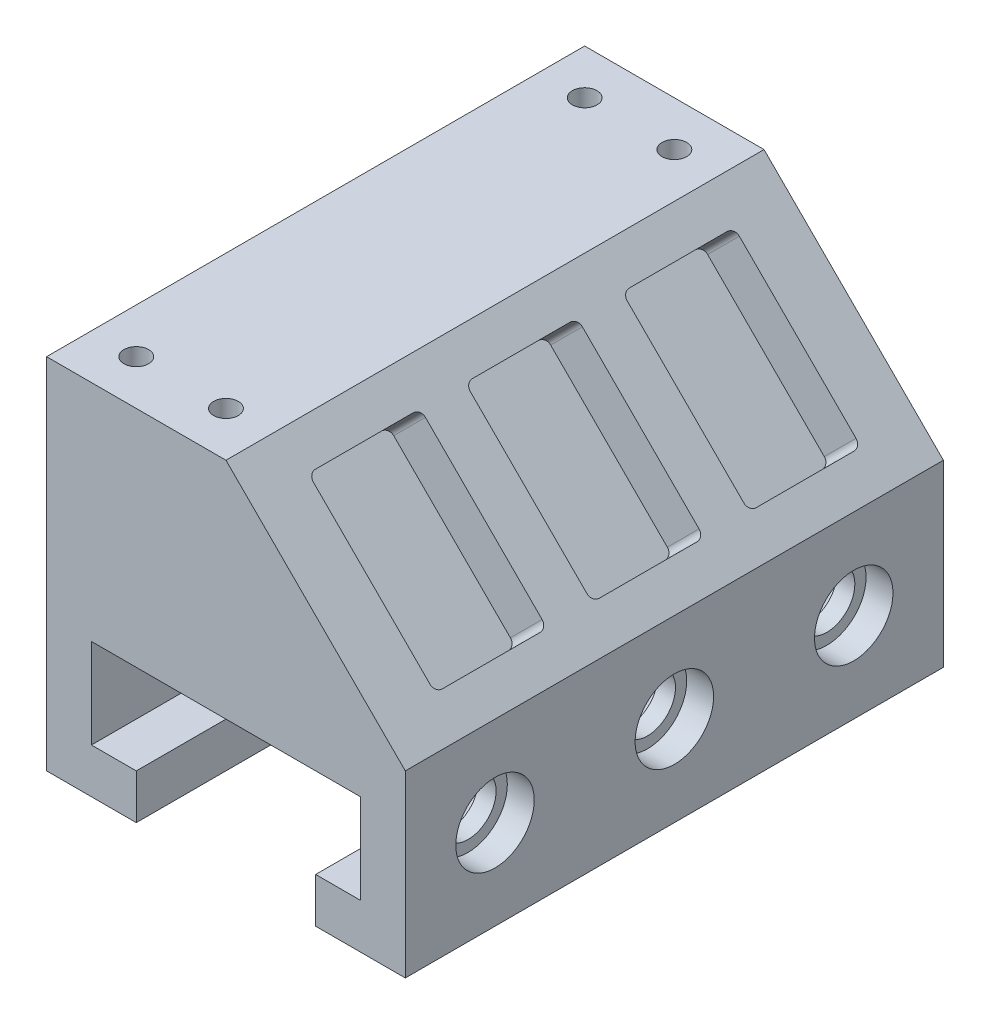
ISO-10303-21;
HEADER;
FILE_DESCRIPTION(('STEP AP214'),'2;1');
FILE_NAME('part.step','',(''),(''),'','','');
FILE_SCHEMA(('AUTOMOTIVE_DESIGN { 1 0 10303 214 1 1 1 1 }'));
ENDSEC;
DATA;
#1=APPLICATION_CONTEXT('core data for automotive mechanical design processes');
#2=APPLICATION_PROTOCOL_DEFINITION('international standard','automotive_design',2000,#1);
#3=PRODUCT_CONTEXT('',#1,'mechanical');
#4=PRODUCT('Part','Part','',(#3));
#5=PRODUCT_RELATED_PRODUCT_CATEGORY('part','',(#4));
#6=PRODUCT_DEFINITION_FORMATION('','',#4);
#7=PRODUCT_DEFINITION_CONTEXT('part definition',#1,'design');
#8=PRODUCT_DEFINITION('design','',#6,#7);
#9=PRODUCT_DEFINITION_SHAPE('','',#8);
#10=(LENGTH_UNIT() NAMED_UNIT(*) SI_UNIT(.MILLI.,.METRE.));
#11=(NAMED_UNIT(*) PLANE_ANGLE_UNIT() SI_UNIT($,.RADIAN.));
#12=(NAMED_UNIT(*) SI_UNIT($,.STERADIAN.) SOLID_ANGLE_UNIT());
#13=UNCERTAINTY_MEASURE_WITH_UNIT(LENGTH_MEASURE(1.E-05),#10,'distance_accuracy_value','');
#14=(GEOMETRIC_REPRESENTATION_CONTEXT(3) GLOBAL_UNCERTAINTY_ASSIGNED_CONTEXT((#13)) GLOBAL_UNIT_ASSIGNED_CONTEXT((#10,
#11,#12)) REPRESENTATION_CONTEXT('',''));
#15=CARTESIAN_POINT('',(0.,0.,0.));
#16=DIRECTION('',(0.,0.,1.));
#17=DIRECTION('',(1.,0.,0.));
#18=AXIS2_PLACEMENT_3D('',#15,#16,#17);
#19=CARTESIAN_POINT('',(25.4,0.,-152.4));
#20=DIRECTION('',(0.,-1.,0.));
#21=DIRECTION('',(1.,0.,0.));
#22=AXIS2_PLACEMENT_3D('',#19,#20,#21);
#23=PLANE('',#22);
#24=DIRECTION('',(1.,0.,0.));
#25=VECTOR('',#24,1.);
#26=CARTESIAN_POINT('',(25.4,0.,0.));
#27=LINE('',#26,#25);
#28=CARTESIAN_POINT('',(0.,0.,0.));
#29=VERTEX_POINT('',#28);
#30=CARTESIAN_POINT('',(25.4,0.,0.));
#31=VERTEX_POINT('',#30);
#32=EDGE_CURVE('E462',#29,#31,#27,.T.);
#33=ORIENTED_EDGE('',*,*,#32,.F.);
#34=DIRECTION('',(0.,0.,1.));
#35=VECTOR('',#34,1.);
#36=CARTESIAN_POINT('',(0.,0.,-152.4));
#37=LINE('',#36,#35);
#38=CARTESIAN_POINT('',(0.,0.,-152.4));
#39=VERTEX_POINT('',#38);
#40=EDGE_CURVE('E555',#39,#29,#37,.T.);
#41=ORIENTED_EDGE('',*,*,#40,.F.);
#42=DIRECTION('',(1.,0.,0.));
#43=VECTOR('',#42,1.);
#44=CARTESIAN_POINT('',(25.4,0.,-152.4));
#45=LINE('',#44,#43);
#46=CARTESIAN_POINT('',(25.4,0.,-152.4));
#47=VERTEX_POINT('',#46);
#48=EDGE_CURVE('E515',#39,#47,#45,.T.);
#49=ORIENTED_EDGE('',*,*,#48,.T.);
#50=DIRECTION('',(0.,0.,1.));
#51=VECTOR('',#50,1.);
#52=CARTESIAN_POINT('',(25.4,0.,-152.4));
#53=LINE('',#52,#51);
#54=EDGE_CURVE('E554',#47,#31,#53,.T.);
#55=ORIENTED_EDGE('',*,*,#54,.T.);
#56=EDGE_LOOP('',(#33,#41,#49,#55));
#57=FACE_BOUND('',#56,.T.);
#58=ADVANCED_FACE('F37',(#57),#23,.T.);
#59=CARTESIAN_POINT('',(0.,0.,-152.4));
#60=DIRECTION('',(-1.,0.,0.));
#61=DIRECTION('',(0.,-1.,0.));
#62=AXIS2_PLACEMENT_3D('',#59,#60,#61);
#63=PLANE('',#62);
#64=CARTESIAN_POINT('',(0.,25.4,-127.));
#65=DIRECTION('',(1.,0.,0.));
#66=DIRECTION('',(0.,0.,-1.));
#67=AXIS2_PLACEMENT_3D('',#64,#65,#66);
#68=CIRCLE('',#67,11.1125);
#69=CARTESIAN_POINT('',(0.,25.4,-138.1125));
#70=VERTEX_POINT('',#69);
#71=EDGE_CURVE('E1084',#70,#70,#68,.T.);
#72=ORIENTED_EDGE('',*,*,#71,.T.);
#73=EDGE_LOOP('',(#72));
#74=FACE_BOUND('',#73,.T.);
#75=CARTESIAN_POINT('',(0.,25.4,-76.2));
#76=DIRECTION('',(1.,0.,0.));
#77=DIRECTION('',(0.,0.,-1.));
#78=AXIS2_PLACEMENT_3D('',#75,#76,#77);
#79=CIRCLE('',#78,11.1125);
#80=CARTESIAN_POINT('',(0.,25.4,-87.3125));
#81=VERTEX_POINT('',#80);
#82=EDGE_CURVE('E1096',#81,#81,#79,.T.);
#83=ORIENTED_EDGE('',*,*,#82,.T.);
#84=EDGE_LOOP('',(#83));
#85=FACE_BOUND('',#84,.T.);
#86=CARTESIAN_POINT('',(0.,25.4,-25.4));
#87=DIRECTION('',(-1.,0.,0.));
#88=DIRECTION('',(0.,0.,1.));
#89=AXIS2_PLACEMENT_3D('',#86,#87,#88);
#90=CIRCLE('',#89,11.1125);
#91=CARTESIAN_POINT('',(0.,25.4,-14.2875));
#92=VERTEX_POINT('',#91);
#93=EDGE_CURVE('E1111',#92,#92,#90,.T.);
#94=ORIENTED_EDGE('',*,*,#93,.F.);
#95=EDGE_LOOP('',(#94));
#96=FACE_BOUND('',#95,.T.);
#97=DIRECTION('',(0.,-1.,0.));
#98=VECTOR('',#97,1.);
#99=CARTESIAN_POINT('',(0.,0.,0.));
#100=LINE('',#99,#98);
#101=CARTESIAN_POINT('',(0.,101.6,0.));
#102=VERTEX_POINT('',#101);
#103=EDGE_CURVE('E512',#102,#29,#100,.T.);
#104=ORIENTED_EDGE('',*,*,#103,.F.);
#105=DIRECTION('',(0.,0.,1.));
#106=VECTOR('',#105,1.);
#107=CARTESIAN_POINT('',(0.,101.6,-152.4));
#108=LINE('',#107,#106);
#109=CARTESIAN_POINT('',(0.,101.6,-152.4));
#110=VERTEX_POINT('',#109);
#111=EDGE_CURVE('E558',#110,#102,#108,.T.);
#112=ORIENTED_EDGE('',*,*,#111,.F.);
#113=DIRECTION('',(0.,-1.,0.));
#114=VECTOR('',#113,1.);
#115=CARTESIAN_POINT('',(0.,0.,-152.4));
#116=LINE('',#115,#114);
#117=EDGE_CURVE('E551',#110,#39,#116,.T.);
#118=ORIENTED_EDGE('',*,*,#117,.T.);
#119=ORIENTED_EDGE('',*,*,#40,.T.);
#120=EDGE_LOOP('',(#104,#112,#118,#119));
#121=FACE_BOUND('',#120,.T.);
#122=ADVANCED_FACE('F619',(#74,#85,#96,#121),#63,.T.);
#123=CARTESIAN_POINT('',(0.,101.6,-152.4));
#124=DIRECTION('',(0.,1.,0.));
#125=DIRECTION('',(0.,0.,1.));
#126=AXIS2_PLACEMENT_3D('',#123,#124,#125);
#127=PLANE('',#126);
#128=CARTESIAN_POINT('',(12.7,101.6,-12.7));
#129=DIRECTION('',(0.,1.,0.));
#130=DIRECTION('',(0.,0.,1.));
#131=AXIS2_PLACEMENT_3D('',#128,#129,#130);
#132=CIRCLE('',#131,3.4925);
#133=CARTESIAN_POINT('',(12.7,101.6,-9.2075));
#134=VERTEX_POINT('',#133);
#135=EDGE_CURVE('E787',#134,#134,#132,.T.);
#136=ORIENTED_EDGE('',*,*,#135,.F.);
#137=EDGE_LOOP('',(#136));
#138=FACE_BOUND('',#137,.T.);
#139=CARTESIAN_POINT('',(38.1,101.6,-12.7));
#140=DIRECTION('',(0.,1.,0.));
#141=DIRECTION('',(0.,0.,1.));
#142=AXIS2_PLACEMENT_3D('',#139,#140,#141);
#143=CIRCLE('',#142,3.4925);
#144=CARTESIAN_POINT('',(38.1,101.6,-9.2075));
#145=VERTEX_POINT('',#144);
#146=EDGE_CURVE('E791',#145,#145,#143,.T.);
#147=ORIENTED_EDGE('',*,*,#146,.F.);
#148=EDGE_LOOP('',(#147));
#149=FACE_BOUND('',#148,.T.);
#150=CARTESIAN_POINT('',(38.1,101.6,-139.7));
#151=DIRECTION('',(0.,1.,0.));
#152=DIRECTION('',(0.,0.,1.));
#153=AXIS2_PLACEMENT_3D('',#150,#151,#152);
#154=CIRCLE('',#153,3.4925);
#155=CARTESIAN_POINT('',(38.1,101.6,-136.2075));
#156=VERTEX_POINT('',#155);
#157=EDGE_CURVE('E795',#156,#156,#154,.T.);
#158=ORIENTED_EDGE('',*,*,#157,.F.);
#159=EDGE_LOOP('',(#158));
#160=FACE_BOUND('',#159,.T.);
#161=CARTESIAN_POINT('',(12.7,101.6,-139.7));
#162=DIRECTION('',(0.,1.,0.));
#163=DIRECTION('',(0.,0.,1.));
#164=AXIS2_PLACEMENT_3D('',#161,#162,#163);
#165=CIRCLE('',#164,3.4925);
#166=CARTESIAN_POINT('',(12.7,101.6,-136.2075));
#167=VERTEX_POINT('',#166);
#168=EDGE_CURVE('E799',#167,#167,#165,.T.);
#169=ORIENTED_EDGE('',*,*,#168,.F.);
#170=EDGE_LOOP('',(#169));
#171=FACE_BOUND('',#170,.T.);
#172=DIRECTION('',(-1.,0.,0.));
#173=VECTOR('',#172,1.);
#174=CARTESIAN_POINT('',(0.,101.6,0.));
#175=LINE('',#174,#173);
#176=CARTESIAN_POINT('',(50.8,101.6,0.));
#177=VERTEX_POINT('',#176);
#178=EDGE_CURVE('E509',#177,#102,#175,.T.);
#179=ORIENTED_EDGE('',*,*,#178,.F.);
#180=DIRECTION('',(0.,0.,1.));
#181=VECTOR('',#180,1.);
#182=CARTESIAN_POINT('',(50.8,101.6,-152.4));
#183=LINE('',#182,#181);
#184=CARTESIAN_POINT('',(50.8,101.6,-152.4));
#185=VERTEX_POINT('',#184);
#186=EDGE_CURVE('E560',#185,#177,#183,.T.);
#187=ORIENTED_EDGE('',*,*,#186,.F.);
#188=DIRECTION('',(-1.,0.,0.));
#189=VECTOR('',#188,1.);
#190=CARTESIAN_POINT('',(0.,101.6,-152.4));
#191=LINE('',#190,#189);
#192=EDGE_CURVE('E548',#185,#110,#191,.T.);
#193=ORIENTED_EDGE('',*,*,#192,.T.);
#194=ORIENTED_EDGE('',*,*,#111,.T.);
#195=EDGE_LOOP('',(#179,#187,#193,#194));
#196=FACE_BOUND('',#195,.T.);
#197=ADVANCED_FACE('F614',(#138,#149,#160,#171,#196),#127,.T.);
#198=CARTESIAN_POINT('',(50.8,101.6,-152.4));
#199=DIRECTION('',(0.707106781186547,0.707106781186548,0.));
#200=DIRECTION('',(-0.707106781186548,0.707106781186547,0.));
#201=AXIS2_PLACEMENT_3D('',#198,#199,#200);
#202=PLANE('',#201);
#203=CARTESIAN_POINT('',(59.6763287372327,92.7236712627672,-45.593));
#204=DIRECTION('',(0.707106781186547,0.707106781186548,0.));
#205=DIRECTION('',(0.707106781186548,-0.707106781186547,0.));
#206=AXIS2_PLACEMENT_3D('',#203,#204,#205);
#207=CIRCLE('',#206,2.032);
#208=CARTESIAN_POINT('',(59.6763287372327,92.7236712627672,-47.625));
#209=VERTEX_POINT('',#208);
#210=CARTESIAN_POINT('',(58.2394877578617,94.1605122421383,-45.593));
#211=VERTEX_POINT('',#210);
#212=EDGE_CURVE('E53',#209,#211,#207,.T.);
#213=ORIENTED_EDGE('',*,*,#212,.F.);
#214=DIRECTION('',(-0.707106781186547,0.707106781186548,0.));
#215=VECTOR('',#214,1.);
#216=CARTESIAN_POINT('',(59.6763287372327,92.7236712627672,-47.625));
#217=LINE('',#216,#215);
#218=CARTESIAN_POINT('',(92.7236712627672,59.6763287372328,-47.625));
#219=VERTEX_POINT('',#218);
#220=EDGE_CURVE('E314',#219,#209,#217,.T.);
#221=ORIENTED_EDGE('',*,*,#220,.F.);
#222=CARTESIAN_POINT('',(92.7236712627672,59.6763287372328,-45.593));
#223=DIRECTION('',(0.707106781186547,0.707106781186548,0.));
#224=DIRECTION('',(-0.707106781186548,0.707106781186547,0.));
#225=AXIS2_PLACEMENT_3D('',#222,#223,#224);
#226=CIRCLE('',#225,2.032);
#227=CARTESIAN_POINT('',(94.1605122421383,58.2394877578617,-45.593));
#228=VERTEX_POINT('',#227);
#229=EDGE_CURVE('E311',#228,#219,#226,.T.);
#230=ORIENTED_EDGE('',*,*,#229,.F.);
#231=DIRECTION('',(0.,0.,-1.));
#232=VECTOR('',#231,1.);
#233=CARTESIAN_POINT('',(94.1605122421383,58.2394877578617,-17.907));
#234=LINE('',#233,#232);
#235=CARTESIAN_POINT('',(94.1605122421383,58.2394877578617,-17.907));
#236=VERTEX_POINT('',#235);
#237=EDGE_CURVE('E308',#236,#228,#234,.T.);
#238=ORIENTED_EDGE('',*,*,#237,.F.);
#239=CARTESIAN_POINT('',(92.7236712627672,59.6763287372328,-17.907));
#240=DIRECTION('',(0.707106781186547,0.707106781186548,0.));
#241=DIRECTION('',(0.707106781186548,-0.707106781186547,0.));
#242=AXIS2_PLACEMENT_3D('',#239,#240,#241);
#243=CIRCLE('',#242,2.032);
#244=CARTESIAN_POINT('',(92.7236712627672,59.6763287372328,-15.875));
#245=VERTEX_POINT('',#244);
#246=EDGE_CURVE('E302',#245,#236,#243,.T.);
#247=ORIENTED_EDGE('',*,*,#246,.F.);
#248=DIRECTION('',(0.707106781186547,-0.707106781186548,0.));
#249=VECTOR('',#248,1.);
#250=CARTESIAN_POINT('',(92.7236712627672,59.6763287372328,-15.875));
#251=LINE('',#250,#249);
#252=CARTESIAN_POINT('',(59.6763287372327,92.7236712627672,-15.875));
#253=VERTEX_POINT('',#252);
#254=EDGE_CURVE('E300',#253,#245,#251,.T.);
#255=ORIENTED_EDGE('',*,*,#254,.F.);
#256=CARTESIAN_POINT('',(59.6763287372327,92.7236712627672,-17.907));
#257=DIRECTION('',(0.707106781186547,0.707106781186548,0.));
#258=DIRECTION('',(0.707106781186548,-0.707106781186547,0.));
#259=AXIS2_PLACEMENT_3D('',#256,#257,#258);
#260=CIRCLE('',#259,2.032);
#261=CARTESIAN_POINT('',(58.2394877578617,94.1605122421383,-17.907));
#262=VERTEX_POINT('',#261);
#263=EDGE_CURVE('E281',#262,#253,#260,.T.);
#264=ORIENTED_EDGE('',*,*,#263,.F.);
#265=DIRECTION('',(0.,0.,1.));
#266=VECTOR('',#265,1.);
#267=CARTESIAN_POINT('',(58.2394877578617,94.1605122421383,-17.907));
#268=LINE('',#267,#266);
#269=EDGE_CURVE('E292',#211,#262,#268,.T.);
#270=ORIENTED_EDGE('',*,*,#269,.F.);
#271=EDGE_LOOP('',(#213,#221,#230,#238,#247,#255,#264,#270));
#272=FACE_BOUND('',#271,.T.);
#273=CARTESIAN_POINT('',(59.6763287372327,92.7236712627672,-90.043));
#274=DIRECTION('',(0.707106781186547,0.707106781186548,0.));
#275=DIRECTION('',(0.707106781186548,-0.707106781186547,0.));
#276=AXIS2_PLACEMENT_3D('',#273,#274,#275);
#277=CIRCLE('',#276,2.032);
#278=CARTESIAN_POINT('',(59.6763287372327,92.7236712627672,-92.075));
#279=VERTEX_POINT('',#278);
#280=CARTESIAN_POINT('',(58.2394877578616,94.1605122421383,-90.043));
#281=VERTEX_POINT('',#280);
#282=EDGE_CURVE('E61',#279,#281,#277,.T.);
#283=ORIENTED_EDGE('',*,*,#282,.F.);
#284=DIRECTION('',(-0.707106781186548,0.707106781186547,0.));
#285=VECTOR('',#284,1.);
#286=CARTESIAN_POINT('',(59.6763287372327,92.7236712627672,-92.075));
#287=LINE('',#286,#285);
#288=CARTESIAN_POINT('',(92.7236712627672,59.6763287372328,-92.075));
#289=VERTEX_POINT('',#288);
#290=EDGE_CURVE('E369',#289,#279,#287,.T.);
#291=ORIENTED_EDGE('',*,*,#290,.F.);
#292=CARTESIAN_POINT('',(92.7236712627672,59.6763287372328,-90.043));
#293=DIRECTION('',(0.707106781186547,0.707106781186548,0.));
#294=DIRECTION('',(-0.707106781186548,0.707106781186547,0.));
#295=AXIS2_PLACEMENT_3D('',#292,#293,#294);
#296=CIRCLE('',#295,2.032);
#297=CARTESIAN_POINT('',(94.1605122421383,58.2394877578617,-90.043));
#298=VERTEX_POINT('',#297);
#299=EDGE_CURVE('E366',#298,#289,#296,.T.);
#300=ORIENTED_EDGE('',*,*,#299,.F.);
#301=DIRECTION('',(0.,0.,-1.));
#302=VECTOR('',#301,1.);
#303=CARTESIAN_POINT('',(94.1605122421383,58.2394877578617,-62.357));
#304=LINE('',#303,#302);
#305=CARTESIAN_POINT('',(94.1605122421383,58.2394877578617,-62.357));
#306=VERTEX_POINT('',#305);
#307=EDGE_CURVE('E363',#306,#298,#304,.T.);
#308=ORIENTED_EDGE('',*,*,#307,.F.);
#309=CARTESIAN_POINT('',(92.7236712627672,59.6763287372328,-62.357));
#310=DIRECTION('',(0.707106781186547,0.707106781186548,0.));
#311=DIRECTION('',(0.707106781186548,-0.707106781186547,0.));
#312=AXIS2_PLACEMENT_3D('',#309,#310,#311);
#313=CIRCLE('',#312,2.032);
#314=CARTESIAN_POINT('',(92.7236712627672,59.6763287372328,-60.325));
#315=VERTEX_POINT('',#314);
#316=EDGE_CURVE('E360',#315,#306,#313,.T.);
#317=ORIENTED_EDGE('',*,*,#316,.F.);
#318=DIRECTION('',(0.707106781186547,-0.707106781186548,0.));
#319=VECTOR('',#318,1.);
#320=CARTESIAN_POINT('',(92.7236712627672,59.6763287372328,-60.325));
#321=LINE('',#320,#319);
#322=CARTESIAN_POINT('',(59.6763287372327,92.7236712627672,-60.325));
#323=VERTEX_POINT('',#322);
#324=EDGE_CURVE('E357',#323,#315,#321,.T.);
#325=ORIENTED_EDGE('',*,*,#324,.F.);
#326=CARTESIAN_POINT('',(59.6763287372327,92.7236712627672,-62.357));
#327=DIRECTION('',(0.707106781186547,0.707106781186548,0.));
#328=DIRECTION('',(0.707106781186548,-0.707106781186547,0.));
#329=AXIS2_PLACEMENT_3D('',#326,#327,#328);
#330=CIRCLE('',#329,2.032);
#331=CARTESIAN_POINT('',(58.2394877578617,94.1605122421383,-62.357));
#332=VERTEX_POINT('',#331);
#333=EDGE_CURVE('E354',#332,#323,#330,.T.);
#334=ORIENTED_EDGE('',*,*,#333,.F.);
#335=DIRECTION('',(0.,0.,1.));
#336=VECTOR('',#335,1.);
#337=CARTESIAN_POINT('',(58.2394877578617,94.1605122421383,-62.357));
#338=LINE('',#337,#336);
#339=EDGE_CURVE('E351',#281,#332,#338,.T.);
#340=ORIENTED_EDGE('',*,*,#339,.F.);
#341=EDGE_LOOP('',(#283,#291,#300,#308,#317,#325,#334,#340));
#342=FACE_BOUND('',#341,.T.);
#343=CARTESIAN_POINT('',(59.6763287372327,92.7236712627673,-134.493));
#344=DIRECTION('',(0.707106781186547,0.707106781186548,0.));
#345=DIRECTION('',(0.707106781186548,-0.707106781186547,0.));
#346=AXIS2_PLACEMENT_3D('',#343,#344,#345);
#347=CIRCLE('',#346,2.032);
#348=CARTESIAN_POINT('',(59.6763287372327,92.7236712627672,-136.525));
#349=VERTEX_POINT('',#348);
#350=CARTESIAN_POINT('',(58.2394877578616,94.1605122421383,-134.493));
#351=VERTEX_POINT('',#350);
#352=EDGE_CURVE('E399',#349,#351,#347,.T.);
#353=ORIENTED_EDGE('',*,*,#352,.F.);
#354=DIRECTION('',(-0.707106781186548,0.707106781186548,0.));
#355=VECTOR('',#354,1.);
#356=CARTESIAN_POINT('',(59.6763287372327,92.7236712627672,-136.525));
#357=LINE('',#356,#355);
#358=CARTESIAN_POINT('',(92.7236712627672,59.6763287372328,-136.525));
#359=VERTEX_POINT('',#358);
#360=EDGE_CURVE('E432',#359,#349,#357,.T.);
#361=ORIENTED_EDGE('',*,*,#360,.F.);
#362=CARTESIAN_POINT('',(92.7236712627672,59.6763287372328,-134.493));
#363=DIRECTION('',(0.707106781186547,0.707106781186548,0.));
#364=DIRECTION('',(-0.707106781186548,0.707106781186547,0.));
#365=AXIS2_PLACEMENT_3D('',#362,#363,#364);
#366=CIRCLE('',#365,2.032);
#367=CARTESIAN_POINT('',(94.1605122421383,58.2394877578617,-134.493));
#368=VERTEX_POINT('',#367);
#369=EDGE_CURVE('E429',#368,#359,#366,.T.);
#370=ORIENTED_EDGE('',*,*,#369,.F.);
#371=DIRECTION('',(0.,0.,-1.));
#372=VECTOR('',#371,1.);
#373=CARTESIAN_POINT('',(94.1605122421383,58.2394877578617,-106.807));
#374=LINE('',#373,#372);
#375=CARTESIAN_POINT('',(94.1605122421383,58.2394877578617,-106.807));
#376=VERTEX_POINT('',#375);
#377=EDGE_CURVE('E426',#376,#368,#374,.T.);
#378=ORIENTED_EDGE('',*,*,#377,.F.);
#379=CARTESIAN_POINT('',(92.7236712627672,59.6763287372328,-106.807));
#380=DIRECTION('',(0.707106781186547,0.707106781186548,0.));
#381=DIRECTION('',(0.707106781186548,-0.707106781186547,0.));
#382=AXIS2_PLACEMENT_3D('',#379,#380,#381);
#383=CIRCLE('',#382,2.032);
#384=CARTESIAN_POINT('',(92.7236712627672,59.6763287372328,-104.775));
#385=VERTEX_POINT('',#384);
#386=EDGE_CURVE('E423',#385,#376,#383,.T.);
#387=ORIENTED_EDGE('',*,*,#386,.F.);
#388=DIRECTION('',(0.707106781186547,-0.707106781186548,0.));
#389=VECTOR('',#388,1.);
#390=CARTESIAN_POINT('',(92.7236712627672,59.6763287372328,-104.775));
#391=LINE('',#390,#389);
#392=CARTESIAN_POINT('',(59.6763287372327,92.7236712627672,-104.775));
#393=VERTEX_POINT('',#392);
#394=EDGE_CURVE('E420',#393,#385,#391,.T.);
#395=ORIENTED_EDGE('',*,*,#394,.F.);
#396=CARTESIAN_POINT('',(59.6763287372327,92.7236712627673,-106.807));
#397=DIRECTION('',(0.707106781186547,0.707106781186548,0.));
#398=DIRECTION('',(0.707106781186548,-0.707106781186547,0.));
#399=AXIS2_PLACEMENT_3D('',#396,#397,#398);
#400=CIRCLE('',#399,2.032);
#401=CARTESIAN_POINT('',(58.2394877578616,94.1605122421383,-106.807));
#402=VERTEX_POINT('',#401);
#403=EDGE_CURVE('E417',#402,#393,#400,.T.);
#404=ORIENTED_EDGE('',*,*,#403,.F.);
#405=DIRECTION('',(0.,0.,1.));
#406=VECTOR('',#405,1.);
#407=CARTESIAN_POINT('',(58.2394877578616,94.1605122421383,-106.807));
#408=LINE('',#407,#406);
#409=EDGE_CURVE('E414',#351,#402,#408,.T.);
#410=ORIENTED_EDGE('',*,*,#409,.F.);
#411=EDGE_LOOP('',(#353,#361,#370,#378,#387,#395,#404,#410));
#412=FACE_BOUND('',#411,.T.);
#413=DIRECTION('',(-0.707106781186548,0.707106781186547,0.));
#414=VECTOR('',#413,1.);
#415=CARTESIAN_POINT('',(50.8,101.6,0.));
#416=LINE('',#415,#414);
#417=CARTESIAN_POINT('',(101.6,50.8,0.));
#418=VERTEX_POINT('',#417);
#419=EDGE_CURVE('E506',#418,#177,#416,.T.);
#420=ORIENTED_EDGE('',*,*,#419,.F.);
#421=DIRECTION('',(0.,0.,1.));
#422=VECTOR('',#421,1.);
#423=CARTESIAN_POINT('',(101.6,50.8,-152.4));
#424=LINE('',#423,#422);
#425=CARTESIAN_POINT('',(101.6,50.8,-152.4));
#426=VERTEX_POINT('',#425);
#427=EDGE_CURVE('E562',#426,#418,#424,.T.);
#428=ORIENTED_EDGE('',*,*,#427,.F.);
#429=DIRECTION('',(-0.707106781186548,0.707106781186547,0.));
#430=VECTOR('',#429,1.);
#431=CARTESIAN_POINT('',(50.8,101.6,-152.4));
#432=LINE('',#431,#430);
#433=EDGE_CURVE('E545',#426,#185,#432,.T.);
#434=ORIENTED_EDGE('',*,*,#433,.T.);
#435=ORIENTED_EDGE('',*,*,#186,.T.);
#436=EDGE_LOOP('',(#420,#428,#434,#435));
#437=FACE_BOUND('',#436,.T.);
#438=ADVANCED_FACE('F296',(#272,#342,#412,#437),#202,.T.);
#439=CARTESIAN_POINT('',(101.6,50.8,-152.4));
#440=DIRECTION('',(1.,0.,0.));
#441=DIRECTION('',(0.,1.,0.));
#442=AXIS2_PLACEMENT_3D('',#439,#440,#441);
#443=PLANE('',#442);
#444=CARTESIAN_POINT('',(101.6,25.4,-76.2));
#445=DIRECTION('',(1.,0.,0.));
#446=DIRECTION('',(0.,0.,-1.));
#447=AXIS2_PLACEMENT_3D('',#444,#445,#446);
#448=CIRCLE('',#447,11.1125);
#449=CARTESIAN_POINT('',(101.6,25.4,-87.3125));
#450=VERTEX_POINT('',#449);
#451=EDGE_CURVE('E1117',#450,#450,#448,.T.);
#452=ORIENTED_EDGE('',*,*,#451,.F.);
#453=EDGE_LOOP('',(#452));
#454=FACE_BOUND('',#453,.T.);
#455=CARTESIAN_POINT('',(101.6,25.4,-25.4));
#456=DIRECTION('',(1.,0.,0.));
#457=DIRECTION('',(0.,0.,-1.));
#458=AXIS2_PLACEMENT_3D('',#455,#456,#457);
#459=CIRCLE('',#458,11.1125);
#460=CARTESIAN_POINT('',(101.6,25.4,-36.5125));
#461=VERTEX_POINT('',#460);
#462=EDGE_CURVE('E584',#461,#461,#459,.T.);
#463=ORIENTED_EDGE('',*,*,#462,.F.);
#464=EDGE_LOOP('',(#463));
#465=FACE_BOUND('',#464,.T.);
#466=DIRECTION('',(0.,1.,0.));
#467=VECTOR('',#466,1.);
#468=CARTESIAN_POINT('',(101.6,50.8,0.));
#469=LINE('',#468,#467);
#470=CARTESIAN_POINT('',(101.6,0.,0.));
#471=VERTEX_POINT('',#470);
#472=EDGE_CURVE('E503',#471,#418,#469,.T.);
#473=ORIENTED_EDGE('',*,*,#472,.F.);
#474=DIRECTION('',(0.,0.,1.));
#475=VECTOR('',#474,1.);
#476=CARTESIAN_POINT('',(101.6,0.,-152.4));
#477=LINE('',#476,#475);
#478=CARTESIAN_POINT('',(101.6,0.,-152.4));
#479=VERTEX_POINT('',#478);
#480=EDGE_CURVE('E564',#479,#471,#477,.T.);
#481=ORIENTED_EDGE('',*,*,#480,.F.);
#482=DIRECTION('',(0.,1.,0.));
#483=VECTOR('',#482,1.);
#484=CARTESIAN_POINT('',(101.6,50.8,-152.4));
#485=LINE('',#484,#483);
#486=EDGE_CURVE('E542',#479,#426,#485,.T.);
#487=ORIENTED_EDGE('',*,*,#486,.T.);
#488=ORIENTED_EDGE('',*,*,#427,.T.);
#489=EDGE_LOOP('',(#473,#481,#487,#488));
#490=FACE_BOUND('',#489,.T.);
#491=CARTESIAN_POINT('',(101.6,25.4,-127.));
#492=DIRECTION('',(1.,0.,0.));
#493=DIRECTION('',(0.,0.,-1.));
#494=AXIS2_PLACEMENT_3D('',#491,#492,#493);
#495=CIRCLE('',#494,11.1125);
#496=CARTESIAN_POINT('',(101.6,25.4,-138.1125));
#497=VERTEX_POINT('',#496);
#498=EDGE_CURVE('E587',#497,#497,#495,.T.);
#499=ORIENTED_EDGE('',*,*,#498,.F.);
#500=EDGE_LOOP('',(#499));
#501=FACE_BOUND('',#500,.T.);
#502=ADVANCED_FACE('F602',(#454,#465,#490,#501),#443,.T.);
#503=CARTESIAN_POINT('',(101.6,0.,-152.4));
#504=DIRECTION('',(0.,-1.,0.));
#505=DIRECTION('',(1.,0.,0.));
#506=AXIS2_PLACEMENT_3D('',#503,#504,#505);
#507=PLANE('',#506);
#508=DIRECTION('',(1.,0.,0.));
#509=VECTOR('',#508,1.);
#510=CARTESIAN_POINT('',(101.6,0.,0.));
#511=LINE('',#510,#509);
#512=CARTESIAN_POINT('',(76.2,0.,0.));
#513=VERTEX_POINT('',#512);
#514=EDGE_CURVE('E500',#513,#471,#511,.T.);
#515=ORIENTED_EDGE('',*,*,#514,.F.);
#516=DIRECTION('',(0.,0.,1.));
#517=VECTOR('',#516,1.);
#518=CARTESIAN_POINT('',(76.2,0.,-152.4));
#519=LINE('',#518,#517);
#520=CARTESIAN_POINT('',(76.2,0.,-152.4));
#521=VERTEX_POINT('',#520);
#522=EDGE_CURVE('E566',#521,#513,#519,.T.);
#523=ORIENTED_EDGE('',*,*,#522,.F.);
#524=DIRECTION('',(1.,0.,0.));
#525=VECTOR('',#524,1.);
#526=CARTESIAN_POINT('',(101.6,0.,-152.4));
#527=LINE('',#526,#525);
#528=EDGE_CURVE('E539',#521,#479,#527,.T.);
#529=ORIENTED_EDGE('',*,*,#528,.T.);
#530=ORIENTED_EDGE('',*,*,#480,.T.);
#531=EDGE_LOOP('',(#515,#523,#529,#530));
#532=FACE_BOUND('',#531,.T.);
#533=ADVANCED_FACE('F604',(#532),#507,.T.);
#534=CARTESIAN_POINT('',(76.2,0.,-152.4));
#535=DIRECTION('',(-1.,0.,0.));
#536=DIRECTION('',(0.,0.,1.));
#537=AXIS2_PLACEMENT_3D('',#534,#535,#536);
#538=PLANE('',#537);
#539=DIRECTION('',(0.,-1.,0.));
#540=VECTOR('',#539,1.);
#541=CARTESIAN_POINT('',(76.2,0.,0.));
#542=LINE('',#541,#540);
#543=CARTESIAN_POINT('',(76.2,12.7,0.));
#544=VERTEX_POINT('',#543);
#545=EDGE_CURVE('E497',#544,#513,#542,.T.);
#546=ORIENTED_EDGE('',*,*,#545,.F.);
#547=DIRECTION('',(0.,0.,1.));
#548=VECTOR('',#547,1.);
#549=CARTESIAN_POINT('',(76.2,12.7,-152.4));
#550=LINE('',#549,#548);
#551=CARTESIAN_POINT('',(76.2,12.7,-152.4));
#552=VERTEX_POINT('',#551);
#553=EDGE_CURVE('E568',#552,#544,#550,.T.);
#554=ORIENTED_EDGE('',*,*,#553,.F.);
#555=DIRECTION('',(0.,-1.,0.));
#556=VECTOR('',#555,1.);
#557=CARTESIAN_POINT('',(76.2,0.,-152.4));
#558=LINE('',#557,#556);
#559=EDGE_CURVE('E536',#552,#521,#558,.T.);
#560=ORIENTED_EDGE('',*,*,#559,.T.);
#561=ORIENTED_EDGE('',*,*,#522,.T.);
#562=EDGE_LOOP('',(#546,#554,#560,#561));
#563=FACE_BOUND('',#562,.T.);
#564=ADVANCED_FACE('F611',(#563),#538,.T.);
#565=CARTESIAN_POINT('',(76.2,12.7,-152.4));
#566=DIRECTION('',(0.,1.,0.));
#567=DIRECTION('',(0.,0.,1.));
#568=AXIS2_PLACEMENT_3D('',#565,#566,#567);
#569=PLANE('',#568);
#570=DIRECTION('',(-1.,0.,0.));
#571=VECTOR('',#570,1.);
#572=CARTESIAN_POINT('',(76.2,12.7,0.));
#573=LINE('',#572,#571);
#574=CARTESIAN_POINT('',(88.9,12.7,0.));
#575=VERTEX_POINT('',#574);
#576=EDGE_CURVE('E494',#575,#544,#573,.T.);
#577=ORIENTED_EDGE('',*,*,#576,.F.);
#578=DIRECTION('',(0.,0.,1.));
#579=VECTOR('',#578,1.);
#580=CARTESIAN_POINT('',(88.9,12.7,-152.4));
#581=LINE('',#580,#579);
#582=CARTESIAN_POINT('',(88.9,12.7,-152.4));
#583=VERTEX_POINT('',#582);
#584=EDGE_CURVE('E570',#583,#575,#581,.T.);
#585=ORIENTED_EDGE('',*,*,#584,.F.);
#586=DIRECTION('',(-1.,0.,0.));
#587=VECTOR('',#586,1.);
#588=CARTESIAN_POINT('',(76.2,12.7,-152.4));
#589=LINE('',#588,#587);
#590=EDGE_CURVE('E533',#583,#552,#589,.T.);
#591=ORIENTED_EDGE('',*,*,#590,.T.);
#592=ORIENTED_EDGE('',*,*,#553,.T.);
#593=EDGE_LOOP('',(#577,#585,#591,#592));
#594=FACE_BOUND('',#593,.T.);
#595=ADVANCED_FACE('F819',(#594),#569,.T.);
#596=CARTESIAN_POINT('',(88.9,12.7,-152.4));
#597=DIRECTION('',(-1.,0.,0.));
#598=DIRECTION('',(0.,0.,1.));
#599=AXIS2_PLACEMENT_3D('',#596,#597,#598);
#600=PLANE('',#599);
#601=CARTESIAN_POINT('',(88.9,25.4,-76.2));
#602=DIRECTION('',(-1.,0.,0.));
#603=DIRECTION('',(0.,0.,1.));
#604=AXIS2_PLACEMENT_3D('',#601,#602,#603);
#605=CIRCLE('',#604,7.9375);
#606=CARTESIAN_POINT('',(88.9,25.4,-68.2625));
#607=VERTEX_POINT('',#606);
#608=EDGE_CURVE('E1114',#607,#607,#605,.T.);
#609=ORIENTED_EDGE('',*,*,#608,.F.);
#610=EDGE_LOOP('',(#609));
#611=FACE_BOUND('',#610,.T.);
#612=CARTESIAN_POINT('',(88.9,25.4,-25.4));
#613=DIRECTION('',(-1.,0.,0.));
#614=DIRECTION('',(0.,0.,1.));
#615=AXIS2_PLACEMENT_3D('',#612,#613,#614);
#616=CIRCLE('',#615,7.9375);
#617=CARTESIAN_POINT('',(88.9,25.4,-17.4625));
#618=VERTEX_POINT('',#617);
#619=EDGE_CURVE('E581',#618,#618,#616,.T.);
#620=ORIENTED_EDGE('',*,*,#619,.F.);
#621=EDGE_LOOP('',(#620));
#622=FACE_BOUND('',#621,.T.);
#623=DIRECTION('',(0.,-1.,0.));
#624=VECTOR('',#623,1.);
#625=CARTESIAN_POINT('',(88.9,12.7,0.));
#626=LINE('',#625,#624);
#627=CARTESIAN_POINT('',(88.9,38.1,0.));
#628=VERTEX_POINT('',#627);
#629=EDGE_CURVE('E491',#628,#575,#626,.T.);
#630=ORIENTED_EDGE('',*,*,#629,.F.);
#631=DIRECTION('',(0.,0.,1.));
#632=VECTOR('',#631,1.);
#633=CARTESIAN_POINT('',(88.9,38.1,-152.4));
#634=LINE('',#633,#632);
#635=CARTESIAN_POINT('',(88.9,38.1,-152.4));
#636=VERTEX_POINT('',#635);
#637=EDGE_CURVE('E572',#636,#628,#634,.T.);
#638=ORIENTED_EDGE('',*,*,#637,.F.);
#639=DIRECTION('',(0.,-1.,0.));
#640=VECTOR('',#639,1.);
#641=CARTESIAN_POINT('',(88.9,12.7,-152.4));
#642=LINE('',#641,#640);
#643=EDGE_CURVE('E530',#636,#583,#642,.T.);
#644=ORIENTED_EDGE('',*,*,#643,.T.);
#645=ORIENTED_EDGE('',*,*,#584,.T.);
#646=EDGE_LOOP('',(#630,#638,#644,#645));
#647=FACE_BOUND('',#646,.T.);
#648=CARTESIAN_POINT('',(88.9,25.4,-127.));
#649=DIRECTION('',(-1.,0.,0.));
#650=DIRECTION('',(0.,0.,1.));
#651=AXIS2_PLACEMENT_3D('',#648,#649,#650);
#652=CIRCLE('',#651,7.9375);
#653=CARTESIAN_POINT('',(88.9,25.4,-119.0625));
#654=VERTEX_POINT('',#653);
#655=EDGE_CURVE('E557',#654,#654,#652,.T.);
#656=ORIENTED_EDGE('',*,*,#655,.F.);
#657=EDGE_LOOP('',(#656));
#658=FACE_BOUND('',#657,.T.);
#659=ADVANCED_FACE('F824',(#611,#622,#647,#658),#600,.T.);
#660=CARTESIAN_POINT('',(88.9,38.1,-152.4));
#661=DIRECTION('',(0.,-1.,0.));
#662=DIRECTION('',(1.,0.,0.));
#663=AXIS2_PLACEMENT_3D('',#660,#661,#662);
#664=PLANE('',#663);
#665=DIRECTION('',(1.,0.,0.));
#666=VECTOR('',#665,1.);
#667=CARTESIAN_POINT('',(88.9,38.1,0.));
#668=LINE('',#667,#666);
#669=CARTESIAN_POINT('',(12.7,38.1,0.));
#670=VERTEX_POINT('',#669);
#671=EDGE_CURVE('E488',#670,#628,#668,.T.);
#672=ORIENTED_EDGE('',*,*,#671,.F.);
#673=DIRECTION('',(0.,0.,1.));
#674=VECTOR('',#673,1.);
#675=CARTESIAN_POINT('',(12.7,38.1,-152.4));
#676=LINE('',#675,#674);
#677=CARTESIAN_POINT('',(12.7,38.1,-152.4));
#678=VERTEX_POINT('',#677);
#679=EDGE_CURVE('E574',#678,#670,#676,.T.);
#680=ORIENTED_EDGE('',*,*,#679,.F.);
#681=DIRECTION('',(1.,0.,0.));
#682=VECTOR('',#681,1.);
#683=CARTESIAN_POINT('',(88.9,38.1,-152.4));
#684=LINE('',#683,#682);
#685=EDGE_CURVE('E527',#678,#636,#684,.T.);
#686=ORIENTED_EDGE('',*,*,#685,.T.);
#687=ORIENTED_EDGE('',*,*,#637,.T.);
#688=EDGE_LOOP('',(#672,#680,#686,#687));
#689=FACE_BOUND('',#688,.T.);
#690=ADVANCED_FACE('F828',(#689),#664,.T.);
#691=CARTESIAN_POINT('',(12.7,38.1,-152.4));
#692=DIRECTION('',(1.,0.,0.));
#693=DIRECTION('',(0.,0.,-1.));
#694=AXIS2_PLACEMENT_3D('',#691,#692,#693);
#695=PLANE('',#694);
#696=CARTESIAN_POINT('',(12.7,25.4,-127.));
#697=DIRECTION('',(-1.,0.,0.));
#698=DIRECTION('',(0.,0.,1.));
#699=AXIS2_PLACEMENT_3D('',#696,#697,#698);
#700=CIRCLE('',#699,7.9375);
#701=CARTESIAN_POINT('',(12.7,25.4,-119.0625));
#702=VERTEX_POINT('',#701);
#703=EDGE_CURVE('E1081',#702,#702,#700,.T.);
#704=ORIENTED_EDGE('',*,*,#703,.T.);
#705=EDGE_LOOP('',(#704));
#706=FACE_BOUND('',#705,.T.);
#707=CARTESIAN_POINT('',(12.7,25.4,-76.2));
#708=DIRECTION('',(-1.,0.,0.));
#709=DIRECTION('',(0.,0.,1.));
#710=AXIS2_PLACEMENT_3D('',#707,#708,#709);
#711=CIRCLE('',#710,7.9375);
#712=CARTESIAN_POINT('',(12.7,25.4,-68.2625));
#713=VERTEX_POINT('',#712);
#714=EDGE_CURVE('E1093',#713,#713,#711,.T.);
#715=ORIENTED_EDGE('',*,*,#714,.T.);
#716=EDGE_LOOP('',(#715));
#717=FACE_BOUND('',#716,.T.);
#718=CARTESIAN_POINT('',(12.7,25.4,-25.4));
#719=DIRECTION('',(1.,0.,0.));
#720=DIRECTION('',(0.,0.,-1.));
#721=AXIS2_PLACEMENT_3D('',#718,#719,#720);
#722=CIRCLE('',#721,7.9375);
#723=CARTESIAN_POINT('',(12.7,25.4,-33.3375));
#724=VERTEX_POINT('',#723);
#725=EDGE_CURVE('E41',#724,#724,#722,.T.);
#726=ORIENTED_EDGE('',*,*,#725,.F.);
#727=EDGE_LOOP('',(#726));
#728=FACE_BOUND('',#727,.T.);
#729=DIRECTION('',(0.,1.,0.));
#730=VECTOR('',#729,1.);
#731=CARTESIAN_POINT('',(12.7,38.1,0.));
#732=LINE('',#731,#730);
#733=CARTESIAN_POINT('',(12.7,12.7,0.));
#734=VERTEX_POINT('',#733);
#735=EDGE_CURVE('E485',#734,#670,#732,.T.);
#736=ORIENTED_EDGE('',*,*,#735,.F.);
#737=DIRECTION('',(0.,0.,1.));
#738=VECTOR('',#737,1.);
#739=CARTESIAN_POINT('',(12.7,12.7,-152.4));
#740=LINE('',#739,#738);
#741=CARTESIAN_POINT('',(12.7,12.7,-152.4));
#742=VERTEX_POINT('',#741);
#743=EDGE_CURVE('E576',#742,#734,#740,.T.);
#744=ORIENTED_EDGE('',*,*,#743,.F.);
#745=DIRECTION('',(0.,1.,0.));
#746=VECTOR('',#745,1.);
#747=CARTESIAN_POINT('',(12.7,38.1,-152.4));
#748=LINE('',#747,#746);
#749=EDGE_CURVE('E524',#742,#678,#748,.T.);
#750=ORIENTED_EDGE('',*,*,#749,.T.);
#751=ORIENTED_EDGE('',*,*,#679,.T.);
#752=EDGE_LOOP('',(#736,#744,#750,#751));
#753=FACE_BOUND('',#752,.T.);
#754=ADVANCED_FACE('F833',(#706,#717,#728,#753),#695,.T.);
#755=CARTESIAN_POINT('',(12.7,12.7,-152.4));
#756=DIRECTION('',(0.,1.,0.));
#757=DIRECTION('',(0.,0.,1.));
#758=AXIS2_PLACEMENT_3D('',#755,#756,#757);
#759=PLANE('',#758);
#760=DIRECTION('',(-1.,0.,0.));
#761=VECTOR('',#760,1.);
#762=CARTESIAN_POINT('',(12.7,12.7,0.));
#763=LINE('',#762,#761);
#764=CARTESIAN_POINT('',(25.4,12.7,0.));
#765=VERTEX_POINT('',#764);
#766=EDGE_CURVE('E482',#765,#734,#763,.T.);
#767=ORIENTED_EDGE('',*,*,#766,.F.);
#768=DIRECTION('',(0.,0.,1.));
#769=VECTOR('',#768,1.);
#770=CARTESIAN_POINT('',(25.4,12.7,-152.4));
#771=LINE('',#770,#769);
#772=CARTESIAN_POINT('',(25.4,12.7,-152.4));
#773=VERTEX_POINT('',#772);
#774=EDGE_CURVE('E578',#773,#765,#771,.T.);
#775=ORIENTED_EDGE('',*,*,#774,.F.);
#776=DIRECTION('',(-1.,0.,0.));
#777=VECTOR('',#776,1.);
#778=CARTESIAN_POINT('',(12.7,12.7,-152.4));
#779=LINE('',#778,#777);
#780=EDGE_CURVE('E521',#773,#742,#779,.T.);
#781=ORIENTED_EDGE('',*,*,#780,.T.);
#782=ORIENTED_EDGE('',*,*,#743,.T.);
#783=EDGE_LOOP('',(#767,#775,#781,#782));
#784=FACE_BOUND('',#783,.T.);
#785=ADVANCED_FACE('F836',(#784),#759,.T.);
#786=CARTESIAN_POINT('',(25.4,12.7,-152.4));
#787=DIRECTION('',(1.,0.,0.));
#788=DIRECTION('',(0.,1.,0.));
#789=AXIS2_PLACEMENT_3D('',#786,#787,#788);
#790=PLANE('',#789);
#791=DIRECTION('',(0.,1.,0.));
#792=VECTOR('',#791,1.);
#793=CARTESIAN_POINT('',(25.4,12.7,0.));
#794=LINE('',#793,#792);
#795=EDGE_CURVE('E479',#31,#765,#794,.T.);
#796=ORIENTED_EDGE('',*,*,#795,.F.);
#797=ORIENTED_EDGE('',*,*,#54,.F.);
#798=DIRECTION('',(0.,1.,0.));
#799=VECTOR('',#798,1.);
#800=CARTESIAN_POINT('',(25.4,12.7,-152.4));
#801=LINE('',#800,#799);
#802=EDGE_CURVE('E518',#47,#773,#801,.T.);
#803=ORIENTED_EDGE('',*,*,#802,.T.);
#804=ORIENTED_EDGE('',*,*,#774,.T.);
#805=EDGE_LOOP('',(#796,#797,#803,#804));
#806=FACE_BOUND('',#805,.T.);
#807=ADVANCED_FACE('F629',(#806),#790,.T.);
#808=CARTESIAN_POINT('',(76.2,0.,-152.4));
#809=DIRECTION('',(0.,0.,-1.));
#810=DIRECTION('',(-1.,0.,0.));
#811=AXIS2_PLACEMENT_3D('',#808,#809,#810);
#812=PLANE('',#811);
#813=ORIENTED_EDGE('',*,*,#48,.F.);
#814=ORIENTED_EDGE('',*,*,#117,.F.);
#815=ORIENTED_EDGE('',*,*,#192,.F.);
#816=ORIENTED_EDGE('',*,*,#433,.F.);
#817=ORIENTED_EDGE('',*,*,#486,.F.);
#818=ORIENTED_EDGE('',*,*,#528,.F.);
#819=ORIENTED_EDGE('',*,*,#559,.F.);
#820=ORIENTED_EDGE('',*,*,#590,.F.);
#821=ORIENTED_EDGE('',*,*,#643,.F.);
#822=ORIENTED_EDGE('',*,*,#685,.F.);
#823=ORIENTED_EDGE('',*,*,#749,.F.);
#824=ORIENTED_EDGE('',*,*,#780,.F.);
#825=ORIENTED_EDGE('',*,*,#802,.F.);
#826=EDGE_LOOP('',(#813,#814,#815,#816,#817,#818,#819,#820,#821,#822,#823,#824,#825));
#827=FACE_BOUND('',#826,.T.);
#828=ADVANCED_FACE('F775',(#827),#812,.T.);
#829=CARTESIAN_POINT('',(76.2,0.,0.));
#830=DIRECTION('',(0.,0.,-1.));
#831=DIRECTION('',(-1.,0.,0.));
#832=AXIS2_PLACEMENT_3D('',#829,#830,#831);
#833=PLANE('',#832);
#834=ORIENTED_EDGE('',*,*,#32,.T.);
#835=ORIENTED_EDGE('',*,*,#795,.T.);
#836=ORIENTED_EDGE('',*,*,#766,.T.);
#837=ORIENTED_EDGE('',*,*,#735,.T.);
#838=ORIENTED_EDGE('',*,*,#671,.T.);
#839=ORIENTED_EDGE('',*,*,#629,.T.);
#840=ORIENTED_EDGE('',*,*,#576,.T.);
#841=ORIENTED_EDGE('',*,*,#545,.T.);
#842=ORIENTED_EDGE('',*,*,#514,.T.);
#843=ORIENTED_EDGE('',*,*,#472,.T.);
#844=ORIENTED_EDGE('',*,*,#419,.T.);
#845=ORIENTED_EDGE('',*,*,#178,.T.);
#846=ORIENTED_EDGE('',*,*,#103,.T.);
#847=EDGE_LOOP('',(#834,#835,#836,#837,#838,#839,#840,#841,#842,#843,#844,#845,#846));
#848=FACE_BOUND('',#847,.T.);
#849=ADVANCED_FACE('F771',(#848),#833,.F.);
#850=CARTESIAN_POINT('',(50.6960726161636,83.7434151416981,-134.493));
#851=DIRECTION('',(0.707106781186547,0.707106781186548,0.));
#852=DIRECTION('',(-0.707106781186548,0.707106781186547,0.));
#853=AXIS2_PLACEMENT_3D('',#850,#851,#852);
#854=CYLINDRICAL_SURFACE('',#853,2.032);
#855=ORIENTED_EDGE('',*,*,#352,.T.);
#856=DIRECTION('',(0.707106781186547,0.707106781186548,0.));
#857=VECTOR('',#856,1.);
#858=CARTESIAN_POINT('',(49.2592316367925,85.1802561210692,-134.493));
#859=LINE('',#858,#857);
#860=CARTESIAN_POINT('',(49.2592316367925,85.1802561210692,-134.493));
#861=VERTEX_POINT('',#860);
#862=EDGE_CURVE('E459',#861,#351,#859,.T.);
#863=ORIENTED_EDGE('',*,*,#862,.F.);
#864=CARTESIAN_POINT('',(50.6960726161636,83.7434151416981,-134.493));
#865=DIRECTION('',(0.707106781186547,0.707106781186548,0.));
#866=DIRECTION('',(0.707106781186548,-0.707106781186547,0.));
#867=AXIS2_PLACEMENT_3D('',#864,#865,#866);
#868=CIRCLE('',#867,2.032);
#869=CARTESIAN_POINT('',(50.6960726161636,83.7434151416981,-136.525));
#870=VERTEX_POINT('',#869);
#871=EDGE_CURVE('E435',#870,#861,#868,.T.);
#872=ORIENTED_EDGE('',*,*,#871,.F.);
#873=DIRECTION('',(0.707106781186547,0.707106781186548,0.));
#874=VECTOR('',#873,1.);
#875=CARTESIAN_POINT('',(50.6960726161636,83.7434151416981,-136.525));
#876=LINE('',#875,#874);
#877=EDGE_CURVE('E460',#870,#349,#876,.T.);
#878=ORIENTED_EDGE('',*,*,#877,.T.);
#879=EDGE_LOOP('',(#855,#863,#872,#878));
#880=FACE_BOUND('',#879,.T.);
#881=ADVANCED_FACE('F745',(#880),#854,.F.);
#882=CARTESIAN_POINT('',(50.6960726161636,83.7434151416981,-136.525));
#883=DIRECTION('',(0.,0.,-1.));
#884=DIRECTION('',(-1.,0.,0.));
#885=AXIS2_PLACEMENT_3D('',#882,#883,#884);
#886=PLANE('',#885);
#887=ORIENTED_EDGE('',*,*,#360,.T.);
#888=ORIENTED_EDGE('',*,*,#877,.F.);
#889=DIRECTION('',(-0.707106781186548,0.707106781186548,0.));
#890=VECTOR('',#889,1.);
#891=CARTESIAN_POINT('',(50.6960726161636,83.7434151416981,-136.525));
#892=LINE('',#891,#890);
#893=CARTESIAN_POINT('',(83.7434151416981,50.6960726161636,-136.525));
#894=VERTEX_POINT('',#893);
#895=EDGE_CURVE('E456',#894,#870,#892,.T.);
#896=ORIENTED_EDGE('',*,*,#895,.F.);
#897=DIRECTION('',(0.707106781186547,0.707106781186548,0.));
#898=VECTOR('',#897,1.);
#899=CARTESIAN_POINT('',(83.7434151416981,50.6960726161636,-136.525));
#900=LINE('',#899,#898);
#901=EDGE_CURVE('E463',#894,#359,#900,.T.);
#902=ORIENTED_EDGE('',*,*,#901,.T.);
#903=EDGE_LOOP('',(#887,#888,#896,#902));
#904=FACE_BOUND('',#903,.T.);
#905=ADVANCED_FACE('F741',(#904),#886,.F.);
#906=CARTESIAN_POINT('',(83.7434151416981,50.6960726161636,-134.493));
#907=DIRECTION('',(0.707106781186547,0.707106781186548,0.));
#908=DIRECTION('',(-0.707106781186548,0.707106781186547,0.));
#909=AXIS2_PLACEMENT_3D('',#906,#907,#908);
#910=CYLINDRICAL_SURFACE('',#909,2.032);
#911=ORIENTED_EDGE('',*,*,#369,.T.);
#912=ORIENTED_EDGE('',*,*,#901,.F.);
#913=CARTESIAN_POINT('',(83.7434151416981,50.6960726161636,-134.493));
#914=DIRECTION('',(0.707106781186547,0.707106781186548,0.));
#915=DIRECTION('',(-0.707106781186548,0.707106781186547,0.));
#916=AXIS2_PLACEMENT_3D('',#913,#914,#915);
#917=CIRCLE('',#916,2.032);
#918=CARTESIAN_POINT('',(85.1802561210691,49.2592316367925,-134.493));
#919=VERTEX_POINT('',#918);
#920=EDGE_CURVE('E453',#919,#894,#917,.T.);
#921=ORIENTED_EDGE('',*,*,#920,.F.);
#922=DIRECTION('',(0.707106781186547,0.707106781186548,0.));
#923=VECTOR('',#922,1.);
#924=CARTESIAN_POINT('',(85.1802561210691,49.2592316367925,-134.493));
#925=LINE('',#924,#923);
#926=EDGE_CURVE('E465',#919,#368,#925,.T.);
#927=ORIENTED_EDGE('',*,*,#926,.T.);
#928=EDGE_LOOP('',(#911,#912,#921,#927));
#929=FACE_BOUND('',#928,.T.);
#930=ADVANCED_FACE('F744',(#929),#910,.F.);
#931=CARTESIAN_POINT('',(85.1802561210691,49.2592316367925,-106.807));
#932=DIRECTION('',(0.707106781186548,-0.707106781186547,0.));
#933=DIRECTION('',(0.707106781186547,0.707106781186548,0.));
#934=AXIS2_PLACEMENT_3D('',#931,#932,#933);
#935=PLANE('',#934);
#936=ORIENTED_EDGE('',*,*,#377,.T.);
#937=ORIENTED_EDGE('',*,*,#926,.F.);
#938=DIRECTION('',(0.,0.,-1.));
#939=VECTOR('',#938,1.);
#940=CARTESIAN_POINT('',(85.1802561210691,49.2592316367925,-106.807));
#941=LINE('',#940,#939);
#942=CARTESIAN_POINT('',(85.1802561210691,49.2592316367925,-106.807));
#943=VERTEX_POINT('',#942);
#944=EDGE_CURVE('E450',#943,#919,#941,.T.);
#945=ORIENTED_EDGE('',*,*,#944,.F.);
#946=DIRECTION('',(0.707106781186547,0.707106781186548,0.));
#947=VECTOR('',#946,1.);
#948=CARTESIAN_POINT('',(85.1802561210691,49.2592316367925,-106.807));
#949=LINE('',#948,#947);
#950=EDGE_CURVE('E467',#943,#376,#949,.T.);
#951=ORIENTED_EDGE('',*,*,#950,.T.);
#952=EDGE_LOOP('',(#936,#937,#945,#951));
#953=FACE_BOUND('',#952,.T.);
#954=ADVANCED_FACE('F749',(#953),#935,.F.);
#955=CARTESIAN_POINT('',(83.7434151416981,50.6960726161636,-106.807));
#956=DIRECTION('',(0.707106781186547,0.707106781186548,0.));
#957=DIRECTION('',(-0.707106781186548,0.707106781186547,0.));
#958=AXIS2_PLACEMENT_3D('',#955,#956,#957);
#959=CYLINDRICAL_SURFACE('',#958,2.032);
#960=ORIENTED_EDGE('',*,*,#386,.T.);
#961=ORIENTED_EDGE('',*,*,#950,.F.);
#962=CARTESIAN_POINT('',(83.7434151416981,50.6960726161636,-106.807));
#963=DIRECTION('',(0.707106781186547,0.707106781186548,0.));
#964=DIRECTION('',(0.707106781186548,-0.707106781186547,0.));
#965=AXIS2_PLACEMENT_3D('',#962,#963,#964);
#966=CIRCLE('',#965,2.032);
#967=CARTESIAN_POINT('',(83.7434151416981,50.6960726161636,-104.775));
#968=VERTEX_POINT('',#967);
#969=EDGE_CURVE('E447',#968,#943,#966,.T.);
#970=ORIENTED_EDGE('',*,*,#969,.F.);
#971=DIRECTION('',(0.707106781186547,0.707106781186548,0.));
#972=VECTOR('',#971,1.);
#973=CARTESIAN_POINT('',(83.7434151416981,50.6960726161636,-104.775));
#974=LINE('',#973,#972);
#975=EDGE_CURVE('E469',#968,#385,#974,.T.);
#976=ORIENTED_EDGE('',*,*,#975,.T.);
#977=EDGE_LOOP('',(#960,#961,#970,#976));
#978=FACE_BOUND('',#977,.T.);
#979=ADVANCED_FACE('F753',(#978),#959,.F.);
#980=CARTESIAN_POINT('',(83.7434151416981,50.6960726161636,-104.775));
#981=DIRECTION('',(0.,0.,1.));
#982=DIRECTION('',(1.,0.,0.));
#983=AXIS2_PLACEMENT_3D('',#980,#981,#982);
#984=PLANE('',#983);
#985=ORIENTED_EDGE('',*,*,#394,.T.);
#986=ORIENTED_EDGE('',*,*,#975,.F.);
#987=DIRECTION('',(0.707106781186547,-0.707106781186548,0.));
#988=VECTOR('',#987,1.);
#989=CARTESIAN_POINT('',(83.7434151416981,50.6960726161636,-104.775));
#990=LINE('',#989,#988);
#991=CARTESIAN_POINT('',(50.6960726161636,83.7434151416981,-104.775));
#992=VERTEX_POINT('',#991);
#993=EDGE_CURVE('E444',#992,#968,#990,.T.);
#994=ORIENTED_EDGE('',*,*,#993,.F.);
#995=DIRECTION('',(0.707106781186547,0.707106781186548,0.));
#996=VECTOR('',#995,1.);
#997=CARTESIAN_POINT('',(50.6960726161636,83.7434151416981,-104.775));
#998=LINE('',#997,#996);
#999=EDGE_CURVE('E471',#992,#393,#998,.T.);
#1000=ORIENTED_EDGE('',*,*,#999,.T.);
#1001=EDGE_LOOP('',(#985,#986,#994,#1000));
#1002=FACE_BOUND('',#1001,.T.);
#1003=ADVANCED_FACE('F757',(#1002),#984,.F.);
#1004=CARTESIAN_POINT('',(50.6960726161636,83.7434151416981,-106.807));
#1005=DIRECTION('',(0.707106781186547,0.707106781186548,0.));
#1006=DIRECTION('',(-0.707106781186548,0.707106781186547,0.));
#1007=AXIS2_PLACEMENT_3D('',#1004,#1005,#1006);
#1008=CYLINDRICAL_SURFACE('',#1007,2.032);
#1009=ORIENTED_EDGE('',*,*,#403,.T.);
#1010=ORIENTED_EDGE('',*,*,#999,.F.);
#1011=CARTESIAN_POINT('',(50.6960726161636,83.7434151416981,-106.807));
#1012=DIRECTION('',(0.707106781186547,0.707106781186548,0.));
#1013=DIRECTION('',(0.707106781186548,-0.707106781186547,0.));
#1014=AXIS2_PLACEMENT_3D('',#1011,#1012,#1013);
#1015=CIRCLE('',#1014,2.032);
#1016=CARTESIAN_POINT('',(49.2592316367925,85.1802561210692,-106.807));
#1017=VERTEX_POINT('',#1016);
#1018=EDGE_CURVE('E441',#1017,#992,#1015,.T.);
#1019=ORIENTED_EDGE('',*,*,#1018,.F.);
#1020=DIRECTION('',(0.707106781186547,0.707106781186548,0.));
#1021=VECTOR('',#1020,1.);
#1022=CARTESIAN_POINT('',(49.2592316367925,85.1802561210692,-106.807));
#1023=LINE('',#1022,#1021);
#1024=EDGE_CURVE('E473',#1017,#402,#1023,.T.);
#1025=ORIENTED_EDGE('',*,*,#1024,.T.);
#1026=EDGE_LOOP('',(#1009,#1010,#1019,#1025));
#1027=FACE_BOUND('',#1026,.T.);
#1028=ADVANCED_FACE('F761',(#1027),#1008,.F.);
#1029=CARTESIAN_POINT('',(49.2592316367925,85.1802561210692,-106.807));
#1030=DIRECTION('',(-0.707106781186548,0.707106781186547,0.));
#1031=DIRECTION('',(-0.707106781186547,-0.707106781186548,0.));
#1032=AXIS2_PLACEMENT_3D('',#1029,#1030,#1031);
#1033=PLANE('',#1032);
#1034=ORIENTED_EDGE('',*,*,#409,.T.);
#1035=ORIENTED_EDGE('',*,*,#1024,.F.);
#1036=DIRECTION('',(0.,0.,1.));
#1037=VECTOR('',#1036,1.);
#1038=CARTESIAN_POINT('',(49.2592316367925,85.1802561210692,-106.807));
#1039=LINE('',#1038,#1037);
#1040=EDGE_CURVE('E438',#861,#1017,#1039,.T.);
#1041=ORIENTED_EDGE('',*,*,#1040,.F.);
#1042=ORIENTED_EDGE('',*,*,#862,.T.);
#1043=EDGE_LOOP('',(#1034,#1035,#1041,#1042));
#1044=FACE_BOUND('',#1043,.T.);
#1045=ADVANCED_FACE('F739',(#1044),#1033,.F.);
#1046=CARTESIAN_POINT('',(50.6960726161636,83.7434151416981,-134.493));
#1047=DIRECTION('',(-0.707106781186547,-0.707106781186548,0.));
#1048=DIRECTION('',(0.707106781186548,-0.707106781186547,0.));
#1049=AXIS2_PLACEMENT_3D('',#1046,#1047,#1048);
#1050=PLANE('',#1049);
#1051=ORIENTED_EDGE('',*,*,#871,.T.);
#1052=ORIENTED_EDGE('',*,*,#1040,.T.);
#1053=ORIENTED_EDGE('',*,*,#1018,.T.);
#1054=ORIENTED_EDGE('',*,*,#993,.T.);
#1055=ORIENTED_EDGE('',*,*,#969,.T.);
#1056=ORIENTED_EDGE('',*,*,#944,.T.);
#1057=ORIENTED_EDGE('',*,*,#920,.T.);
#1058=ORIENTED_EDGE('',*,*,#895,.T.);
#1059=EDGE_LOOP('',(#1051,#1052,#1053,#1054,#1055,#1056,#1057,#1058));
#1060=FACE_BOUND('',#1059,.T.);
#1061=ADVANCED_FACE('F736',(#1060),#1050,.F.);
#1062=CARTESIAN_POINT('',(50.6960726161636,83.7434151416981,-90.043));
#1063=DIRECTION('',(0.707106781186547,0.707106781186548,0.));
#1064=DIRECTION('',(-0.707106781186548,0.707106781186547,0.));
#1065=AXIS2_PLACEMENT_3D('',#1062,#1063,#1064);
#1066=CYLINDRICAL_SURFACE('',#1065,2.032);
#1067=ORIENTED_EDGE('',*,*,#282,.T.);
#1068=DIRECTION('',(0.707106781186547,0.707106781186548,0.));
#1069=VECTOR('',#1068,1.);
#1070=CARTESIAN_POINT('',(49.2592316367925,85.1802561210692,-90.043));
#1071=LINE('',#1070,#1069);
#1072=CARTESIAN_POINT('',(49.2592316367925,85.1802561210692,-90.043));
#1073=VERTEX_POINT('',#1072);
#1074=EDGE_CURVE('E396',#1073,#281,#1071,.T.);
#1075=ORIENTED_EDGE('',*,*,#1074,.F.);
#1076=CARTESIAN_POINT('',(50.6960726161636,83.7434151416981,-90.043));
#1077=DIRECTION('',(0.707106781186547,0.707106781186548,0.));
#1078=DIRECTION('',(0.707106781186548,-0.707106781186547,0.));
#1079=AXIS2_PLACEMENT_3D('',#1076,#1077,#1078);
#1080=CIRCLE('',#1079,2.032);
#1081=CARTESIAN_POINT('',(50.6960726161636,83.7434151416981,-92.075));
#1082=VERTEX_POINT('',#1081);
#1083=EDGE_CURVE('E372',#1082,#1073,#1080,.T.);
#1084=ORIENTED_EDGE('',*,*,#1083,.F.);
#1085=DIRECTION('',(0.707106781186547,0.707106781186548,0.));
#1086=VECTOR('',#1085,1.);
#1087=CARTESIAN_POINT('',(50.6960726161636,83.7434151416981,-92.075));
#1088=LINE('',#1087,#1086);
#1089=EDGE_CURVE('E397',#1082,#279,#1088,.T.);
#1090=ORIENTED_EDGE('',*,*,#1089,.T.);
#1091=EDGE_LOOP('',(#1067,#1075,#1084,#1090));
#1092=FACE_BOUND('',#1091,.T.);
#1093=ADVANCED_FACE('F710',(#1092),#1066,.F.);
#1094=CARTESIAN_POINT('',(50.6960726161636,83.7434151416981,-92.075));
#1095=DIRECTION('',(0.,0.,-1.));
#1096=DIRECTION('',(-1.,0.,0.));
#1097=AXIS2_PLACEMENT_3D('',#1094,#1095,#1096);
#1098=PLANE('',#1097);
#1099=ORIENTED_EDGE('',*,*,#290,.T.);
#1100=ORIENTED_EDGE('',*,*,#1089,.F.);
#1101=DIRECTION('',(-0.707106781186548,0.707106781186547,0.));
#1102=VECTOR('',#1101,1.);
#1103=CARTESIAN_POINT('',(50.6960726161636,83.7434151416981,-92.075));
#1104=LINE('',#1103,#1102);
#1105=CARTESIAN_POINT('',(83.7434151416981,50.6960726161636,-92.075));
#1106=VERTEX_POINT('',#1105);
#1107=EDGE_CURVE('E393',#1106,#1082,#1104,.T.);
#1108=ORIENTED_EDGE('',*,*,#1107,.F.);
#1109=DIRECTION('',(0.707106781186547,0.707106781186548,0.));
#1110=VECTOR('',#1109,1.);
#1111=CARTESIAN_POINT('',(83.7434151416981,50.6960726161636,-92.075));
#1112=LINE('',#1111,#1110);
#1113=EDGE_CURVE('E400',#1106,#289,#1112,.T.);
#1114=ORIENTED_EDGE('',*,*,#1113,.T.);
#1115=EDGE_LOOP('',(#1099,#1100,#1108,#1114));
#1116=FACE_BOUND('',#1115,.T.);
#1117=ADVANCED_FACE('F706',(#1116),#1098,.F.);
#1118=CARTESIAN_POINT('',(83.7434151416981,50.6960726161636,-90.043));
#1119=DIRECTION('',(0.707106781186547,0.707106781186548,0.));
#1120=DIRECTION('',(-0.707106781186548,0.707106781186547,0.));
#1121=AXIS2_PLACEMENT_3D('',#1118,#1119,#1120);
#1122=CYLINDRICAL_SURFACE('',#1121,2.032);
#1123=ORIENTED_EDGE('',*,*,#299,.T.);
#1124=ORIENTED_EDGE('',*,*,#1113,.F.);
#1125=CARTESIAN_POINT('',(83.7434151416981,50.6960726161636,-90.043));
#1126=DIRECTION('',(0.707106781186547,0.707106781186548,0.));
#1127=DIRECTION('',(-0.707106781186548,0.707106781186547,0.));
#1128=AXIS2_PLACEMENT_3D('',#1125,#1126,#1127);
#1129=CIRCLE('',#1128,2.032);
#1130=CARTESIAN_POINT('',(85.1802561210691,49.2592316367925,-90.043));
#1131=VERTEX_POINT('',#1130);
#1132=EDGE_CURVE('E390',#1131,#1106,#1129,.T.);
#1133=ORIENTED_EDGE('',*,*,#1132,.F.);
#1134=DIRECTION('',(0.707106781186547,0.707106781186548,0.));
#1135=VECTOR('',#1134,1.);
#1136=CARTESIAN_POINT('',(85.1802561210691,49.2592316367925,-90.043));
#1137=LINE('',#1136,#1135);
#1138=EDGE_CURVE('E402',#1131,#298,#1137,.T.);
#1139=ORIENTED_EDGE('',*,*,#1138,.T.);
#1140=EDGE_LOOP('',(#1123,#1124,#1133,#1139));
#1141=FACE_BOUND('',#1140,.T.);
#1142=ADVANCED_FACE('F709',(#1141),#1122,.F.);
#1143=CARTESIAN_POINT('',(85.1802561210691,49.2592316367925,-62.357));
#1144=DIRECTION('',(0.707106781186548,-0.707106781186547,0.));
#1145=DIRECTION('',(0.707106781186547,0.707106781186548,0.));
#1146=AXIS2_PLACEMENT_3D('',#1143,#1144,#1145);
#1147=PLANE('',#1146);
#1148=ORIENTED_EDGE('',*,*,#307,.T.);
#1149=ORIENTED_EDGE('',*,*,#1138,.F.);
#1150=DIRECTION('',(0.,0.,-1.));
#1151=VECTOR('',#1150,1.);
#1152=CARTESIAN_POINT('',(85.1802561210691,49.2592316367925,-62.357));
#1153=LINE('',#1152,#1151);
#1154=CARTESIAN_POINT('',(85.1802561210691,49.2592316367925,-62.357));
#1155=VERTEX_POINT('',#1154);
#1156=EDGE_CURVE('E387',#1155,#1131,#1153,.T.);
#1157=ORIENTED_EDGE('',*,*,#1156,.F.);
#1158=DIRECTION('',(0.707106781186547,0.707106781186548,0.));
#1159=VECTOR('',#1158,1.);
#1160=CARTESIAN_POINT('',(85.1802561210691,49.2592316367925,-62.357));
#1161=LINE('',#1160,#1159);
#1162=EDGE_CURVE('E404',#1155,#306,#1161,.T.);
#1163=ORIENTED_EDGE('',*,*,#1162,.T.);
#1164=EDGE_LOOP('',(#1148,#1149,#1157,#1163));
#1165=FACE_BOUND('',#1164,.T.);
#1166=ADVANCED_FACE('F714',(#1165),#1147,.F.);
#1167=CARTESIAN_POINT('',(83.7434151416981,50.6960726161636,-62.357));
#1168=DIRECTION('',(0.707106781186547,0.707106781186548,0.));
#1169=DIRECTION('',(-0.707106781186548,0.707106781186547,0.));
#1170=AXIS2_PLACEMENT_3D('',#1167,#1168,#1169);
#1171=CYLINDRICAL_SURFACE('',#1170,2.032);
#1172=ORIENTED_EDGE('',*,*,#316,.T.);
#1173=ORIENTED_EDGE('',*,*,#1162,.F.);
#1174=CARTESIAN_POINT('',(83.7434151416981,50.6960726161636,-62.357));
#1175=DIRECTION('',(0.707106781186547,0.707106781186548,0.));
#1176=DIRECTION('',(0.707106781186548,-0.707106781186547,0.));
#1177=AXIS2_PLACEMENT_3D('',#1174,#1175,#1176);
#1178=CIRCLE('',#1177,2.032);
#1179=CARTESIAN_POINT('',(83.7434151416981,50.6960726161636,-60.325));
#1180=VERTEX_POINT('',#1179);
#1181=EDGE_CURVE('E384',#1180,#1155,#1178,.T.);
#1182=ORIENTED_EDGE('',*,*,#1181,.F.);
#1183=DIRECTION('',(0.707106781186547,0.707106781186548,0.));
#1184=VECTOR('',#1183,1.);
#1185=CARTESIAN_POINT('',(83.7434151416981,50.6960726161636,-60.325));
#1186=LINE('',#1185,#1184);
#1187=EDGE_CURVE('E406',#1180,#315,#1186,.T.);
#1188=ORIENTED_EDGE('',*,*,#1187,.T.);
#1189=EDGE_LOOP('',(#1172,#1173,#1182,#1188));
#1190=FACE_BOUND('',#1189,.T.);
#1191=ADVANCED_FACE('F718',(#1190),#1171,.F.);
#1192=CARTESIAN_POINT('',(83.7434151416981,50.6960726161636,-60.325));
#1193=DIRECTION('',(0.,0.,1.));
#1194=DIRECTION('',(1.,0.,0.));
#1195=AXIS2_PLACEMENT_3D('',#1192,#1193,#1194);
#1196=PLANE('',#1195);
#1197=ORIENTED_EDGE('',*,*,#324,.T.);
#1198=ORIENTED_EDGE('',*,*,#1187,.F.);
#1199=DIRECTION('',(0.707106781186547,-0.707106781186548,0.));
#1200=VECTOR('',#1199,1.);
#1201=CARTESIAN_POINT('',(83.7434151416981,50.6960726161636,-60.325));
#1202=LINE('',#1201,#1200);
#1203=CARTESIAN_POINT('',(50.6960726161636,83.7434151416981,-60.325));
#1204=VERTEX_POINT('',#1203);
#1205=EDGE_CURVE('E381',#1204,#1180,#1202,.T.);
#1206=ORIENTED_EDGE('',*,*,#1205,.F.);
#1207=DIRECTION('',(0.707106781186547,0.707106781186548,0.));
#1208=VECTOR('',#1207,1.);
#1209=CARTESIAN_POINT('',(50.6960726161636,83.7434151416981,-60.325));
#1210=LINE('',#1209,#1208);
#1211=EDGE_CURVE('E408',#1204,#323,#1210,.T.);
#1212=ORIENTED_EDGE('',*,*,#1211,.T.);
#1213=EDGE_LOOP('',(#1197,#1198,#1206,#1212));
#1214=FACE_BOUND('',#1213,.T.);
#1215=ADVANCED_FACE('F722',(#1214),#1196,.F.);
#1216=CARTESIAN_POINT('',(50.6960726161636,83.7434151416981,-62.357));
#1217=DIRECTION('',(0.707106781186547,0.707106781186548,0.));
#1218=DIRECTION('',(-0.707106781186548,0.707106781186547,0.));
#1219=AXIS2_PLACEMENT_3D('',#1216,#1217,#1218);
#1220=CYLINDRICAL_SURFACE('',#1219,2.032);
#1221=ORIENTED_EDGE('',*,*,#333,.T.);
#1222=ORIENTED_EDGE('',*,*,#1211,.F.);
#1223=CARTESIAN_POINT('',(50.6960726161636,83.7434151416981,-62.357));
#1224=DIRECTION('',(0.707106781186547,0.707106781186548,0.));
#1225=DIRECTION('',(0.707106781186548,-0.707106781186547,0.));
#1226=AXIS2_PLACEMENT_3D('',#1223,#1224,#1225);
#1227=CIRCLE('',#1226,2.032);
#1228=CARTESIAN_POINT('',(49.2592316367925,85.1802561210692,-62.357));
#1229=VERTEX_POINT('',#1228);
#1230=EDGE_CURVE('E378',#1229,#1204,#1227,.T.);
#1231=ORIENTED_EDGE('',*,*,#1230,.F.);
#1232=DIRECTION('',(0.707106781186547,0.707106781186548,0.));
#1233=VECTOR('',#1232,1.);
#1234=CARTESIAN_POINT('',(49.2592316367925,85.1802561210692,-62.357));
#1235=LINE('',#1234,#1233);
#1236=EDGE_CURVE('E410',#1229,#332,#1235,.T.);
#1237=ORIENTED_EDGE('',*,*,#1236,.T.);
#1238=EDGE_LOOP('',(#1221,#1222,#1231,#1237));
#1239=FACE_BOUND('',#1238,.T.);
#1240=ADVANCED_FACE('F726',(#1239),#1220,.F.);
#1241=CARTESIAN_POINT('',(49.2592316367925,85.1802561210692,-62.357));
#1242=DIRECTION('',(-0.707106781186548,0.707106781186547,0.));
#1243=DIRECTION('',(-0.707106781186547,-0.707106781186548,0.));
#1244=AXIS2_PLACEMENT_3D('',#1241,#1242,#1243);
#1245=PLANE('',#1244);
#1246=ORIENTED_EDGE('',*,*,#339,.T.);
#1247=ORIENTED_EDGE('',*,*,#1236,.F.);
#1248=DIRECTION('',(0.,0.,1.));
#1249=VECTOR('',#1248,1.);
#1250=CARTESIAN_POINT('',(49.2592316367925,85.1802561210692,-62.357));
#1251=LINE('',#1250,#1249);
#1252=EDGE_CURVE('E375',#1073,#1229,#1251,.T.);
#1253=ORIENTED_EDGE('',*,*,#1252,.F.);
#1254=ORIENTED_EDGE('',*,*,#1074,.T.);
#1255=EDGE_LOOP('',(#1246,#1247,#1253,#1254));
#1256=FACE_BOUND('',#1255,.T.);
#1257=ADVANCED_FACE('F704',(#1256),#1245,.F.);
#1258=CARTESIAN_POINT('',(50.6960726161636,83.7434151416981,-90.043));
#1259=DIRECTION('',(-0.707106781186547,-0.707106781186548,0.));
#1260=DIRECTION('',(0.707106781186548,-0.707106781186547,0.));
#1261=AXIS2_PLACEMENT_3D('',#1258,#1259,#1260);
#1262=PLANE('',#1261);
#1263=ORIENTED_EDGE('',*,*,#1083,.T.);
#1264=ORIENTED_EDGE('',*,*,#1252,.T.);
#1265=ORIENTED_EDGE('',*,*,#1230,.T.);
#1266=ORIENTED_EDGE('',*,*,#1205,.T.);
#1267=ORIENTED_EDGE('',*,*,#1181,.T.);
#1268=ORIENTED_EDGE('',*,*,#1156,.T.);
#1269=ORIENTED_EDGE('',*,*,#1132,.T.);
#1270=ORIENTED_EDGE('',*,*,#1107,.T.);
#1271=EDGE_LOOP('',(#1263,#1264,#1265,#1266,#1267,#1268,#1269,#1270));
#1272=FACE_BOUND('',#1271,.T.);
#1273=ADVANCED_FACE('F701',(#1272),#1262,.F.);
#1274=CARTESIAN_POINT('',(50.6960726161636,83.7434151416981,-45.593));
#1275=DIRECTION('',(0.707106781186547,0.707106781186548,0.));
#1276=DIRECTION('',(-0.707106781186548,0.707106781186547,0.));
#1277=AXIS2_PLACEMENT_3D('',#1274,#1275,#1276);
#1278=CYLINDRICAL_SURFACE('',#1277,2.032);
#1279=ORIENTED_EDGE('',*,*,#212,.T.);
#1280=DIRECTION('',(0.707106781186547,0.707106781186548,0.));
#1281=VECTOR('',#1280,1.);
#1282=CARTESIAN_POINT('',(49.2592316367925,85.1802561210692,-45.593));
#1283=LINE('',#1282,#1281);
#1284=CARTESIAN_POINT('',(49.2592316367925,85.1802561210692,-45.593));
#1285=VERTEX_POINT('',#1284);
#1286=EDGE_CURVE('E289',#1285,#211,#1283,.T.);
#1287=ORIENTED_EDGE('',*,*,#1286,.F.);
#1288=CARTESIAN_POINT('',(50.6960726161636,83.7434151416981,-45.593));
#1289=DIRECTION('',(0.707106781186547,0.707106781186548,0.));
#1290=DIRECTION('',(0.707106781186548,-0.707106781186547,0.));
#1291=AXIS2_PLACEMENT_3D('',#1288,#1289,#1290);
#1292=CIRCLE('',#1291,2.032);
#1293=CARTESIAN_POINT('',(50.6960726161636,83.7434151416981,-47.625));
#1294=VERTEX_POINT('',#1293);
#1295=EDGE_CURVE('E317',#1294,#1285,#1292,.T.);
#1296=ORIENTED_EDGE('',*,*,#1295,.F.);
#1297=DIRECTION('',(0.707106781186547,0.707106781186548,0.));
#1298=VECTOR('',#1297,1.);
#1299=CARTESIAN_POINT('',(50.6960726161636,83.7434151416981,-47.625));
#1300=LINE('',#1299,#1298);
#1301=EDGE_CURVE('E338',#1294,#209,#1300,.T.);
#1302=ORIENTED_EDGE('',*,*,#1301,.T.);
#1303=EDGE_LOOP('',(#1279,#1287,#1296,#1302));
#1304=FACE_BOUND('',#1303,.T.);
#1305=ADVANCED_FACE('F678',(#1304),#1278,.F.);
#1306=CARTESIAN_POINT('',(50.6960726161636,83.7434151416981,-47.625));
#1307=DIRECTION('',(0.,0.,-1.));
#1308=DIRECTION('',(-1.,0.,0.));
#1309=AXIS2_PLACEMENT_3D('',#1306,#1307,#1308);
#1310=PLANE('',#1309);
#1311=ORIENTED_EDGE('',*,*,#220,.T.);
#1312=ORIENTED_EDGE('',*,*,#1301,.F.);
#1313=DIRECTION('',(-0.707106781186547,0.707106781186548,0.));
#1314=VECTOR('',#1313,1.);
#1315=CARTESIAN_POINT('',(50.6960726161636,83.7434151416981,-47.625));
#1316=LINE('',#1315,#1314);
#1317=CARTESIAN_POINT('',(83.7434151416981,50.6960726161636,-47.625));
#1318=VERTEX_POINT('',#1317);
#1319=EDGE_CURVE('E335',#1318,#1294,#1316,.T.);
#1320=ORIENTED_EDGE('',*,*,#1319,.F.);
#1321=DIRECTION('',(0.707106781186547,0.707106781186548,0.));
#1322=VECTOR('',#1321,1.);
#1323=CARTESIAN_POINT('',(83.7434151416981,50.6960726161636,-47.625));
#1324=LINE('',#1323,#1322);
#1325=EDGE_CURVE('E340',#1318,#219,#1324,.T.);
#1326=ORIENTED_EDGE('',*,*,#1325,.T.);
#1327=EDGE_LOOP('',(#1311,#1312,#1320,#1326));
#1328=FACE_BOUND('',#1327,.T.);
#1329=ADVANCED_FACE('F674',(#1328),#1310,.F.);
#1330=CARTESIAN_POINT('',(83.7434151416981,50.6960726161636,-45.593));
#1331=DIRECTION('',(0.707106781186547,0.707106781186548,0.));
#1332=DIRECTION('',(-0.707106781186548,0.707106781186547,0.));
#1333=AXIS2_PLACEMENT_3D('',#1330,#1331,#1332);
#1334=CYLINDRICAL_SURFACE('',#1333,2.032);
#1335=ORIENTED_EDGE('',*,*,#229,.T.);
#1336=ORIENTED_EDGE('',*,*,#1325,.F.);
#1337=CARTESIAN_POINT('',(83.7434151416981,50.6960726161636,-45.593));
#1338=DIRECTION('',(0.707106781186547,0.707106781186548,0.));
#1339=DIRECTION('',(-0.707106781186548,0.707106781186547,0.));
#1340=AXIS2_PLACEMENT_3D('',#1337,#1338,#1339);
#1341=CIRCLE('',#1340,2.032);
#1342=CARTESIAN_POINT('',(85.1802561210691,49.2592316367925,-45.593));
#1343=VERTEX_POINT('',#1342);
#1344=EDGE_CURVE('E332',#1343,#1318,#1341,.T.);
#1345=ORIENTED_EDGE('',*,*,#1344,.F.);
#1346=DIRECTION('',(0.707106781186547,0.707106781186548,0.));
#1347=VECTOR('',#1346,1.);
#1348=CARTESIAN_POINT('',(85.1802561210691,49.2592316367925,-45.593));
#1349=LINE('',#1348,#1347);
#1350=EDGE_CURVE('E342',#1343,#228,#1349,.T.);
#1351=ORIENTED_EDGE('',*,*,#1350,.T.);
#1352=EDGE_LOOP('',(#1335,#1336,#1345,#1351));
#1353=FACE_BOUND('',#1352,.T.);
#1354=ADVANCED_FACE('F677',(#1353),#1334,.F.);
#1355=CARTESIAN_POINT('',(85.1802561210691,49.2592316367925,-17.907));
#1356=DIRECTION('',(0.707106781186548,-0.707106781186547,0.));
#1357=DIRECTION('',(0.707106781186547,0.707106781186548,0.));
#1358=AXIS2_PLACEMENT_3D('',#1355,#1356,#1357);
#1359=PLANE('',#1358);
#1360=ORIENTED_EDGE('',*,*,#237,.T.);
#1361=ORIENTED_EDGE('',*,*,#1350,.F.);
#1362=DIRECTION('',(0.,0.,-1.));
#1363=VECTOR('',#1362,1.);
#1364=CARTESIAN_POINT('',(85.1802561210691,49.2592316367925,-17.907));
#1365=LINE('',#1364,#1363);
#1366=CARTESIAN_POINT('',(85.1802561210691,49.2592316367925,-17.907));
#1367=VERTEX_POINT('',#1366);
#1368=EDGE_CURVE('E329',#1367,#1343,#1365,.T.);
#1369=ORIENTED_EDGE('',*,*,#1368,.F.);
#1370=DIRECTION('',(0.707106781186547,0.707106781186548,0.));
#1371=VECTOR('',#1370,1.);
#1372=CARTESIAN_POINT('',(85.1802561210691,49.2592316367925,-17.907));
#1373=LINE('',#1372,#1371);
#1374=EDGE_CURVE('E344',#1367,#236,#1373,.T.);
#1375=ORIENTED_EDGE('',*,*,#1374,.T.);
#1376=EDGE_LOOP('',(#1360,#1361,#1369,#1375));
#1377=FACE_BOUND('',#1376,.T.);
#1378=ADVANCED_FACE('F682',(#1377),#1359,.F.);
#1379=CARTESIAN_POINT('',(83.7434151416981,50.6960726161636,-17.907));
#1380=DIRECTION('',(0.707106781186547,0.707106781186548,0.));
#1381=DIRECTION('',(-0.707106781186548,0.707106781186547,0.));
#1382=AXIS2_PLACEMENT_3D('',#1379,#1380,#1381);
#1383=CYLINDRICAL_SURFACE('',#1382,2.032);
#1384=ORIENTED_EDGE('',*,*,#246,.T.);
#1385=ORIENTED_EDGE('',*,*,#1374,.F.);
#1386=CARTESIAN_POINT('',(83.7434151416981,50.6960726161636,-17.907));
#1387=DIRECTION('',(0.707106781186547,0.707106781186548,0.));
#1388=DIRECTION('',(0.707106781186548,-0.707106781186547,0.));
#1389=AXIS2_PLACEMENT_3D('',#1386,#1387,#1388);
#1390=CIRCLE('',#1389,2.032);
#1391=CARTESIAN_POINT('',(83.7434151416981,50.6960726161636,-15.875));
#1392=VERTEX_POINT('',#1391);
#1393=EDGE_CURVE('E326',#1392,#1367,#1390,.T.);
#1394=ORIENTED_EDGE('',*,*,#1393,.F.);
#1395=DIRECTION('',(0.707106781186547,0.707106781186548,0.));
#1396=VECTOR('',#1395,1.);
#1397=CARTESIAN_POINT('',(83.7434151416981,50.6960726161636,-15.875));
#1398=LINE('',#1397,#1396);
#1399=EDGE_CURVE('E346',#1392,#245,#1398,.T.);
#1400=ORIENTED_EDGE('',*,*,#1399,.T.);
#1401=EDGE_LOOP('',(#1384,#1385,#1394,#1400));
#1402=FACE_BOUND('',#1401,.T.);
#1403=ADVANCED_FACE('F686',(#1402),#1383,.F.);
#1404=CARTESIAN_POINT('',(83.7434151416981,50.6960726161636,-15.875));
#1405=DIRECTION('',(0.,0.,1.));
#1406=DIRECTION('',(1.,0.,0.));
#1407=AXIS2_PLACEMENT_3D('',#1404,#1405,#1406);
#1408=PLANE('',#1407);
#1409=ORIENTED_EDGE('',*,*,#254,.T.);
#1410=ORIENTED_EDGE('',*,*,#1399,.F.);
#1411=DIRECTION('',(0.707106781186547,-0.707106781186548,0.));
#1412=VECTOR('',#1411,1.);
#1413=CARTESIAN_POINT('',(83.7434151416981,50.6960726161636,-15.875));
#1414=LINE('',#1413,#1412);
#1415=CARTESIAN_POINT('',(50.6960726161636,83.7434151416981,-15.875));
#1416=VERTEX_POINT('',#1415);
#1417=EDGE_CURVE('E323',#1416,#1392,#1414,.T.);
#1418=ORIENTED_EDGE('',*,*,#1417,.F.);
#1419=DIRECTION('',(0.707106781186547,0.707106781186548,0.));
#1420=VECTOR('',#1419,1.);
#1421=CARTESIAN_POINT('',(50.6960726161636,83.7434151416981,-15.875));
#1422=LINE('',#1421,#1420);
#1423=EDGE_CURVE('E288',#1416,#253,#1422,.T.);
#1424=ORIENTED_EDGE('',*,*,#1423,.T.);
#1425=EDGE_LOOP('',(#1409,#1410,#1418,#1424));
#1426=FACE_BOUND('',#1425,.T.);
#1427=ADVANCED_FACE('F690',(#1426),#1408,.F.);
#1428=CARTESIAN_POINT('',(50.6960726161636,83.7434151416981,-17.907));
#1429=DIRECTION('',(0.707106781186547,0.707106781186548,0.));
#1430=DIRECTION('',(-0.707106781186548,0.707106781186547,0.));
#1431=AXIS2_PLACEMENT_3D('',#1428,#1429,#1430);
#1432=CYLINDRICAL_SURFACE('',#1431,2.032);
#1433=ORIENTED_EDGE('',*,*,#263,.T.);
#1434=ORIENTED_EDGE('',*,*,#1423,.F.);
#1435=CARTESIAN_POINT('',(50.6960726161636,83.7434151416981,-17.907));
#1436=DIRECTION('',(0.707106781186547,0.707106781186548,0.));
#1437=DIRECTION('',(0.707106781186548,-0.707106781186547,0.));
#1438=AXIS2_PLACEMENT_3D('',#1435,#1436,#1437);
#1439=CIRCLE('',#1438,2.032);
#1440=CARTESIAN_POINT('',(49.2592316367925,85.1802561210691,-17.907));
#1441=VERTEX_POINT('',#1440);
#1442=EDGE_CURVE('E284',#1441,#1416,#1439,.T.);
#1443=ORIENTED_EDGE('',*,*,#1442,.F.);
#1444=DIRECTION('',(0.707106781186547,0.707106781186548,0.));
#1445=VECTOR('',#1444,1.);
#1446=CARTESIAN_POINT('',(49.2592316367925,85.1802561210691,-17.907));
#1447=LINE('',#1446,#1445);
#1448=EDGE_CURVE('E277',#1441,#262,#1447,.T.);
#1449=ORIENTED_EDGE('',*,*,#1448,.T.);
#1450=EDGE_LOOP('',(#1433,#1434,#1443,#1449));
#1451=FACE_BOUND('',#1450,.T.);
#1452=ADVANCED_FACE('F279',(#1451),#1432,.F.);
#1453=CARTESIAN_POINT('',(49.2592316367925,85.1802561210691,-17.907));
#1454=DIRECTION('',(-0.707106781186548,0.707106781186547,0.));
#1455=DIRECTION('',(-0.707106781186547,-0.707106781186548,0.));
#1456=AXIS2_PLACEMENT_3D('',#1453,#1454,#1455);
#1457=PLANE('',#1456);
#1458=ORIENTED_EDGE('',*,*,#269,.T.);
#1459=ORIENTED_EDGE('',*,*,#1448,.F.);
#1460=DIRECTION('',(0.,0.,1.));
#1461=VECTOR('',#1460,1.);
#1462=CARTESIAN_POINT('',(49.2592316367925,85.1802561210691,-17.907));
#1463=LINE('',#1462,#1461);
#1464=EDGE_CURVE('E320',#1285,#1441,#1463,.T.);
#1465=ORIENTED_EDGE('',*,*,#1464,.F.);
#1466=ORIENTED_EDGE('',*,*,#1286,.T.);
#1467=EDGE_LOOP('',(#1458,#1459,#1465,#1466));
#1468=FACE_BOUND('',#1467,.T.);
#1469=ADVANCED_FACE('F293',(#1468),#1457,.F.);
#1470=CARTESIAN_POINT('',(50.6960726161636,83.7434151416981,-45.593));
#1471=DIRECTION('',(-0.707106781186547,-0.707106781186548,0.));
#1472=DIRECTION('',(0.707106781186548,-0.707106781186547,0.));
#1473=AXIS2_PLACEMENT_3D('',#1470,#1471,#1472);
#1474=PLANE('',#1473);
#1475=ORIENTED_EDGE('',*,*,#1295,.T.);
#1476=ORIENTED_EDGE('',*,*,#1464,.T.);
#1477=ORIENTED_EDGE('',*,*,#1442,.T.);
#1478=ORIENTED_EDGE('',*,*,#1417,.T.);
#1479=ORIENTED_EDGE('',*,*,#1393,.T.);
#1480=ORIENTED_EDGE('',*,*,#1368,.T.);
#1481=ORIENTED_EDGE('',*,*,#1344,.T.);
#1482=ORIENTED_EDGE('',*,*,#1319,.T.);
#1483=EDGE_LOOP('',(#1475,#1476,#1477,#1478,#1479,#1480,#1481,#1482));
#1484=FACE_BOUND('',#1483,.T.);
#1485=ADVANCED_FACE('F669',(#1484),#1474,.F.);
#1486=CARTESIAN_POINT('',(101.6,25.4,-25.4));
#1487=DIRECTION('',(1.,0.,0.));
#1488=DIRECTION('',(0.,0.,-1.));
#1489=AXIS2_PLACEMENT_3D('',#1486,#1487,#1488);
#1490=CYLINDRICAL_SURFACE('',#1489,11.1125);
#1491=CARTESIAN_POINT('',(93.98,25.4,-25.4));
#1492=DIRECTION('',(1.,0.,0.));
#1493=DIRECTION('',(0.,0.,-1.));
#1494=AXIS2_PLACEMENT_3D('',#1491,#1492,#1493);
#1495=CIRCLE('',#1494,11.1125);
#1496=CARTESIAN_POINT('',(93.98,25.4,-36.5125));
#1497=VERTEX_POINT('',#1496);
#1498=EDGE_CURVE('E1129',#1497,#1497,#1495,.T.);
#1499=ORIENTED_EDGE('',*,*,#1498,.F.);
#1500=EDGE_LOOP('',(#1499));
#1501=FACE_BOUND('',#1500,.T.);
#1502=ORIENTED_EDGE('',*,*,#462,.T.);
#1503=EDGE_LOOP('',(#1502));
#1504=FACE_BOUND('',#1503,.T.);
#1505=ADVANCED_FACE('F665',(#1501,#1504),#1490,.F.);
#1506=CARTESIAN_POINT('',(93.98,33.3375,-25.4));
#1507=DIRECTION('',(-1.,0.,0.));
#1508=DIRECTION('',(0.,0.,1.));
#1509=AXIS2_PLACEMENT_3D('',#1506,#1507,#1508);
#1510=PLANE('',#1509);
#1511=CARTESIAN_POINT('',(93.98,25.4,-25.4));
#1512=DIRECTION('',(1.,0.,0.));
#1513=DIRECTION('',(0.,0.,-1.));
#1514=AXIS2_PLACEMENT_3D('',#1511,#1512,#1513);
#1515=CIRCLE('',#1514,7.9375);
#1516=CARTESIAN_POINT('',(93.98,25.4,-33.3375));
#1517=VERTEX_POINT('',#1516);
#1518=EDGE_CURVE('E1126',#1517,#1517,#1515,.T.);
#1519=ORIENTED_EDGE('',*,*,#1518,.F.);
#1520=EDGE_LOOP('',(#1519));
#1521=FACE_BOUND('',#1520,.T.);
#1522=ORIENTED_EDGE('',*,*,#1498,.T.);
#1523=EDGE_LOOP('',(#1522));
#1524=FACE_BOUND('',#1523,.T.);
#1525=ADVANCED_FACE('F657',(#1521,#1524),#1510,.F.);
#1526=CARTESIAN_POINT('',(101.6,25.4,-25.4));
#1527=DIRECTION('',(1.,0.,0.));
#1528=DIRECTION('',(0.,0.,-1.));
#1529=AXIS2_PLACEMENT_3D('',#1526,#1527,#1528);
#1530=CYLINDRICAL_SURFACE('',#1529,7.9375);
#1531=ORIENTED_EDGE('',*,*,#619,.T.);
#1532=EDGE_LOOP('',(#1531));
#1533=FACE_BOUND('',#1532,.T.);
#1534=ORIENTED_EDGE('',*,*,#1518,.T.);
#1535=EDGE_LOOP('',(#1534));
#1536=FACE_BOUND('',#1535,.T.);
#1537=ADVANCED_FACE('F647',(#1533,#1536),#1530,.F.);
#1538=CARTESIAN_POINT('',(101.6,25.4,-76.2));
#1539=DIRECTION('',(1.,0.,0.));
#1540=DIRECTION('',(0.,0.,-1.));
#1541=AXIS2_PLACEMENT_3D('',#1538,#1539,#1540);
#1542=CYLINDRICAL_SURFACE('',#1541,11.1125);
#1543=CARTESIAN_POINT('',(93.98,25.4,-76.2));
#1544=DIRECTION('',(1.,0.,0.));
#1545=DIRECTION('',(0.,0.,-1.));
#1546=AXIS2_PLACEMENT_3D('',#1543,#1544,#1545);
#1547=CIRCLE('',#1546,11.1125);
#1548=CARTESIAN_POINT('',(93.98,25.4,-87.3125));
#1549=VERTEX_POINT('',#1548);
#1550=EDGE_CURVE('E1123',#1549,#1549,#1547,.T.);
#1551=ORIENTED_EDGE('',*,*,#1550,.F.);
#1552=EDGE_LOOP('',(#1551));
#1553=FACE_BOUND('',#1552,.T.);
#1554=ORIENTED_EDGE('',*,*,#451,.T.);
#1555=EDGE_LOOP('',(#1554));
#1556=FACE_BOUND('',#1555,.T.);
#1557=ADVANCED_FACE('F638',(#1553,#1556),#1542,.F.);
#1558=CARTESIAN_POINT('',(93.98,33.3375,-76.2));
#1559=DIRECTION('',(-1.,0.,0.));
#1560=DIRECTION('',(0.,0.,1.));
#1561=AXIS2_PLACEMENT_3D('',#1558,#1559,#1560);
#1562=PLANE('',#1561);
#1563=CARTESIAN_POINT('',(93.98,25.4,-76.2));
#1564=DIRECTION('',(1.,0.,0.));
#1565=DIRECTION('',(0.,0.,-1.));
#1566=AXIS2_PLACEMENT_3D('',#1563,#1564,#1565);
#1567=CIRCLE('',#1566,7.9375);
#1568=CARTESIAN_POINT('',(93.98,25.4,-84.1375));
#1569=VERTEX_POINT('',#1568);
#1570=EDGE_CURVE('E1120',#1569,#1569,#1567,.T.);
#1571=ORIENTED_EDGE('',*,*,#1570,.F.);
#1572=EDGE_LOOP('',(#1571));
#1573=FACE_BOUND('',#1572,.T.);
#1574=ORIENTED_EDGE('',*,*,#1550,.T.);
#1575=EDGE_LOOP('',(#1574));
#1576=FACE_BOUND('',#1575,.T.);
#1577=ADVANCED_FACE('F644',(#1573,#1576),#1562,.F.);
#1578=CARTESIAN_POINT('',(101.6,25.4,-76.2));
#1579=DIRECTION('',(1.,0.,0.));
#1580=DIRECTION('',(0.,0.,-1.));
#1581=AXIS2_PLACEMENT_3D('',#1578,#1579,#1580);
#1582=CYLINDRICAL_SURFACE('',#1581,7.9375);
#1583=ORIENTED_EDGE('',*,*,#608,.T.);
#1584=EDGE_LOOP('',(#1583));
#1585=FACE_BOUND('',#1584,.T.);
#1586=ORIENTED_EDGE('',*,*,#1570,.T.);
#1587=EDGE_LOOP('',(#1586));
#1588=FACE_BOUND('',#1587,.T.);
#1589=ADVANCED_FACE('F636',(#1585,#1588),#1582,.F.);
#1590=CARTESIAN_POINT('',(101.6,25.4,-127.));
#1591=DIRECTION('',(1.,0.,0.));
#1592=DIRECTION('',(0.,0.,-1.));
#1593=AXIS2_PLACEMENT_3D('',#1590,#1591,#1592);
#1594=CYLINDRICAL_SURFACE('',#1593,7.9375);
#1595=ORIENTED_EDGE('',*,*,#655,.T.);
#1596=EDGE_LOOP('',(#1595));
#1597=FACE_BOUND('',#1596,.T.);
#1598=CARTESIAN_POINT('',(93.98,25.4,-127.));
#1599=DIRECTION('',(1.,0.,0.));
#1600=DIRECTION('',(0.,0.,-1.));
#1601=AXIS2_PLACEMENT_3D('',#1598,#1599,#1600);
#1602=CIRCLE('',#1601,7.9375);
#1603=CARTESIAN_POINT('',(93.98,25.4,-134.9375));
#1604=VERTEX_POINT('',#1603);
#1605=EDGE_CURVE('E11',#1604,#1604,#1602,.T.);
#1606=ORIENTED_EDGE('',*,*,#1605,.T.);
#1607=EDGE_LOOP('',(#1606));
#1608=FACE_BOUND('',#1607,.T.);
#1609=ADVANCED_FACE('F39',(#1597,#1608),#1594,.F.);
#1610=CARTESIAN_POINT('',(93.98,33.3375,-127.));
#1611=DIRECTION('',(-1.,0.,0.));
#1612=DIRECTION('',(0.,0.,1.));
#1613=AXIS2_PLACEMENT_3D('',#1610,#1611,#1612);
#1614=PLANE('',#1613);
#1615=ORIENTED_EDGE('',*,*,#1605,.F.);
#1616=EDGE_LOOP('',(#1615));
#1617=FACE_BOUND('',#1616,.T.);
#1618=CARTESIAN_POINT('',(93.98,25.4,-127.));
#1619=DIRECTION('',(1.,0.,0.));
#1620=DIRECTION('',(0.,0.,-1.));
#1621=AXIS2_PLACEMENT_3D('',#1618,#1619,#1620);
#1622=CIRCLE('',#1621,11.1125);
#1623=CARTESIAN_POINT('',(93.98,25.4,-138.1125));
#1624=VERTEX_POINT('',#1623);
#1625=EDGE_CURVE('E46',#1624,#1624,#1622,.T.);
#1626=ORIENTED_EDGE('',*,*,#1625,.T.);
#1627=EDGE_LOOP('',(#1626));
#1628=FACE_BOUND('',#1627,.T.);
#1629=ADVANCED_FACE('F593',(#1617,#1628),#1614,.F.);
#1630=CARTESIAN_POINT('',(101.6,25.4,-127.));
#1631=DIRECTION('',(1.,0.,0.));
#1632=DIRECTION('',(0.,0.,-1.));
#1633=AXIS2_PLACEMENT_3D('',#1630,#1631,#1632);
#1634=CYLINDRICAL_SURFACE('',#1633,11.1125);
#1635=ORIENTED_EDGE('',*,*,#1625,.F.);
#1636=EDGE_LOOP('',(#1635));
#1637=FACE_BOUND('',#1636,.T.);
#1638=ORIENTED_EDGE('',*,*,#498,.T.);
#1639=EDGE_LOOP('',(#1638));
#1640=FACE_BOUND('',#1639,.T.);
#1641=ADVANCED_FACE('F595',(#1637,#1640),#1634,.F.);
#1642=CARTESIAN_POINT('',(0.,25.4,-25.4));
#1643=DIRECTION('',(-1.,0.,0.));
#1644=DIRECTION('',(0.,0.,1.));
#1645=AXIS2_PLACEMENT_3D('',#1642,#1643,#1644);
#1646=CYLINDRICAL_SURFACE('',#1645,11.1125);
#1647=CARTESIAN_POINT('',(7.62000000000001,25.4,-25.4));
#1648=DIRECTION('',(-1.,0.,0.));
#1649=DIRECTION('',(0.,0.,1.));
#1650=AXIS2_PLACEMENT_3D('',#1647,#1648,#1649);
#1651=CIRCLE('',#1650,11.1125);
#1652=CARTESIAN_POINT('',(7.62000000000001,25.4,-14.2875));
#1653=VERTEX_POINT('',#1652);
#1654=EDGE_CURVE('E1108',#1653,#1653,#1651,.T.);
#1655=ORIENTED_EDGE('',*,*,#1654,.F.);
#1656=EDGE_LOOP('',(#1655));
#1657=FACE_BOUND('',#1656,.T.);
#1658=ORIENTED_EDGE('',*,*,#93,.T.);
#1659=EDGE_LOOP('',(#1658));
#1660=FACE_BOUND('',#1659,.T.);
#1661=ADVANCED_FACE('F598',(#1657,#1660),#1646,.F.);
#1662=CARTESIAN_POINT('',(7.62000000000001,33.3375,-25.4));
#1663=DIRECTION('',(1.,0.,0.));
#1664=DIRECTION('',(0.,0.,-1.));
#1665=AXIS2_PLACEMENT_3D('',#1662,#1663,#1664);
#1666=PLANE('',#1665);
#1667=CARTESIAN_POINT('',(7.62000000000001,25.4,-25.4));
#1668=DIRECTION('',(-1.,0.,0.));
#1669=DIRECTION('',(0.,0.,1.));
#1670=AXIS2_PLACEMENT_3D('',#1667,#1668,#1669);
#1671=CIRCLE('',#1670,7.9375);
#1672=CARTESIAN_POINT('',(7.62000000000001,25.4,-17.4625));
#1673=VERTEX_POINT('',#1672);
#1674=EDGE_CURVE('E1105',#1673,#1673,#1671,.T.);
#1675=ORIENTED_EDGE('',*,*,#1674,.F.);
#1676=EDGE_LOOP('',(#1675));
#1677=FACE_BOUND('',#1676,.T.);
#1678=ORIENTED_EDGE('',*,*,#1654,.T.);
#1679=EDGE_LOOP('',(#1678));
#1680=FACE_BOUND('',#1679,.T.);
#1681=ADVANCED_FACE('F893',(#1677,#1680),#1666,.F.);
#1682=CARTESIAN_POINT('',(0.,25.4,-25.4));
#1683=DIRECTION('',(-1.,0.,0.));
#1684=DIRECTION('',(0.,0.,1.));
#1685=AXIS2_PLACEMENT_3D('',#1682,#1683,#1684);
#1686=CYLINDRICAL_SURFACE('',#1685,7.9375);
#1687=ORIENTED_EDGE('',*,*,#725,.T.);
#1688=EDGE_LOOP('',(#1687));
#1689=FACE_BOUND('',#1688,.T.);
#1690=ORIENTED_EDGE('',*,*,#1674,.T.);
#1691=EDGE_LOOP('',(#1690));
#1692=FACE_BOUND('',#1691,.T.);
#1693=ADVANCED_FACE('F904',(#1689,#1692),#1686,.F.);
#1694=CARTESIAN_POINT('',(0.,25.4,-76.2));
#1695=DIRECTION('',(-1.,0.,0.));
#1696=DIRECTION('',(0.,0.,-1.));
#1697=AXIS2_PLACEMENT_3D('',#1694,#1695,#1696);
#1698=CYLINDRICAL_SURFACE('',#1697,11.1125);
#1699=CARTESIAN_POINT('',(7.62000000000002,25.4,-76.2));
#1700=DIRECTION('',(1.,0.,0.));
#1701=DIRECTION('',(0.,0.,-1.));
#1702=AXIS2_PLACEMENT_3D('',#1699,#1700,#1701);
#1703=CIRCLE('',#1702,11.1125);
#1704=CARTESIAN_POINT('',(7.62000000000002,25.4,-87.3125));
#1705=VERTEX_POINT('',#1704);
#1706=EDGE_CURVE('E1102',#1705,#1705,#1703,.T.);
#1707=ORIENTED_EDGE('',*,*,#1706,.T.);
#1708=EDGE_LOOP('',(#1707));
#1709=FACE_BOUND('',#1708,.T.);
#1710=ORIENTED_EDGE('',*,*,#82,.F.);
#1711=EDGE_LOOP('',(#1710));
#1712=FACE_BOUND('',#1711,.T.);
#1713=ADVANCED_FACE('F914',(#1709,#1712),#1698,.F.);
#1714=CARTESIAN_POINT('',(7.62000000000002,33.3375,-76.2));
#1715=DIRECTION('',(1.,0.,0.));
#1716=DIRECTION('',(0.,0.,1.));
#1717=AXIS2_PLACEMENT_3D('',#1714,#1715,#1716);
#1718=PLANE('',#1717);
#1719=CARTESIAN_POINT('',(7.62000000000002,25.4,-76.2));
#1720=DIRECTION('',(1.,0.,0.));
#1721=DIRECTION('',(0.,0.,-1.));
#1722=AXIS2_PLACEMENT_3D('',#1719,#1720,#1721);
#1723=CIRCLE('',#1722,7.9375);
#1724=CARTESIAN_POINT('',(7.62000000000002,25.4,-84.1375));
#1725=VERTEX_POINT('',#1724);
#1726=EDGE_CURVE('E1099',#1725,#1725,#1723,.T.);
#1727=ORIENTED_EDGE('',*,*,#1726,.T.);
#1728=EDGE_LOOP('',(#1727));
#1729=FACE_BOUND('',#1728,.T.);
#1730=ORIENTED_EDGE('',*,*,#1706,.F.);
#1731=EDGE_LOOP('',(#1730));
#1732=FACE_BOUND('',#1731,.T.);
#1733=ADVANCED_FACE('F924',(#1729,#1732),#1718,.F.);
#1734=CARTESIAN_POINT('',(0.,25.4,-76.2));
#1735=DIRECTION('',(-1.,0.,0.));
#1736=DIRECTION('',(0.,0.,-1.));
#1737=AXIS2_PLACEMENT_3D('',#1734,#1735,#1736);
#1738=CYLINDRICAL_SURFACE('',#1737,7.9375);
#1739=ORIENTED_EDGE('',*,*,#714,.F.);
#1740=EDGE_LOOP('',(#1739));
#1741=FACE_BOUND('',#1740,.T.);
#1742=ORIENTED_EDGE('',*,*,#1726,.F.);
#1743=EDGE_LOOP('',(#1742));
#1744=FACE_BOUND('',#1743,.T.);
#1745=ADVANCED_FACE('F934',(#1741,#1744),#1738,.F.);
#1746=CARTESIAN_POINT('',(0.,25.4,-127.));
#1747=DIRECTION('',(-1.,0.,0.));
#1748=DIRECTION('',(0.,0.,-1.));
#1749=AXIS2_PLACEMENT_3D('',#1746,#1747,#1748);
#1750=CYLINDRICAL_SURFACE('',#1749,11.1125);
#1751=CARTESIAN_POINT('',(7.62000000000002,25.4,-127.));
#1752=DIRECTION('',(1.,0.,0.));
#1753=DIRECTION('',(0.,0.,-1.));
#1754=AXIS2_PLACEMENT_3D('',#1751,#1752,#1753);
#1755=CIRCLE('',#1754,11.1125);
#1756=CARTESIAN_POINT('',(7.62000000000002,25.4,-138.1125));
#1757=VERTEX_POINT('',#1756);
#1758=EDGE_CURVE('E1090',#1757,#1757,#1755,.T.);
#1759=ORIENTED_EDGE('',*,*,#1758,.T.);
#1760=EDGE_LOOP('',(#1759));
#1761=FACE_BOUND('',#1760,.T.);
#1762=ORIENTED_EDGE('',*,*,#71,.F.);
#1763=EDGE_LOOP('',(#1762));
#1764=FACE_BOUND('',#1763,.T.);
#1765=ADVANCED_FACE('F944',(#1761,#1764),#1750,.F.);
#1766=CARTESIAN_POINT('',(7.62000000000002,33.3375,-127.));
#1767=DIRECTION('',(1.,0.,0.));
#1768=DIRECTION('',(0.,0.,1.));
#1769=AXIS2_PLACEMENT_3D('',#1766,#1767,#1768);
#1770=PLANE('',#1769);
#1771=CARTESIAN_POINT('',(7.62000000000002,25.4,-127.));
#1772=DIRECTION('',(1.,0.,0.));
#1773=DIRECTION('',(0.,0.,-1.));
#1774=AXIS2_PLACEMENT_3D('',#1771,#1772,#1773);
#1775=CIRCLE('',#1774,7.9375);
#1776=CARTESIAN_POINT('',(7.62000000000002,25.4,-134.9375));
#1777=VERTEX_POINT('',#1776);
#1778=EDGE_CURVE('E1087',#1777,#1777,#1775,.T.);
#1779=ORIENTED_EDGE('',*,*,#1778,.T.);
#1780=EDGE_LOOP('',(#1779));
#1781=FACE_BOUND('',#1780,.T.);
#1782=ORIENTED_EDGE('',*,*,#1758,.F.);
#1783=EDGE_LOOP('',(#1782));
#1784=FACE_BOUND('',#1783,.T.);
#1785=ADVANCED_FACE('F954',(#1781,#1784),#1770,.F.);
#1786=CARTESIAN_POINT('',(0.,25.4,-127.));
#1787=DIRECTION('',(-1.,0.,0.));
#1788=DIRECTION('',(0.,0.,-1.));
#1789=AXIS2_PLACEMENT_3D('',#1786,#1787,#1788);
#1790=CYLINDRICAL_SURFACE('',#1789,7.9375);
#1791=ORIENTED_EDGE('',*,*,#703,.F.);
#1792=EDGE_LOOP('',(#1791));
#1793=FACE_BOUND('',#1792,.T.);
#1794=ORIENTED_EDGE('',*,*,#1778,.F.);
#1795=EDGE_LOOP('',(#1794));
#1796=FACE_BOUND('',#1795,.T.);
#1797=ADVANCED_FACE('F964',(#1793,#1796),#1790,.F.);
#1798=CARTESIAN_POINT('',(12.7,76.2,-139.7));
#1799=DIRECTION('',(0.,1.,0.));
#1800=DIRECTION('',(0.,0.,1.));
#1801=AXIS2_PLACEMENT_3D('',#1798,#1799,#1800);
#1802=CYLINDRICAL_SURFACE('',#1801,3.4925);
#1803=CARTESIAN_POINT('',(12.7,76.2,-139.7));
#1804=DIRECTION('',(0.,1.,0.));
#1805=DIRECTION('',(0.,0.,1.));
#1806=AXIS2_PLACEMENT_3D('',#1803,#1804,#1805);
#1807=CIRCLE('',#1806,3.4925);
#1808=CARTESIAN_POINT('',(12.7,76.2,-136.2075));
#1809=VERTEX_POINT('',#1808);
#1810=EDGE_CURVE('E1078',#1809,#1809,#1807,.T.);
#1811=ORIENTED_EDGE('',*,*,#1810,.F.);
#1812=EDGE_LOOP('',(#1811));
#1813=FACE_BOUND('',#1812,.T.);
#1814=ORIENTED_EDGE('',*,*,#168,.T.);
#1815=EDGE_LOOP('',(#1814));
#1816=FACE_BOUND('',#1815,.T.);
#1817=ADVANCED_FACE('F973',(#1813,#1816),#1802,.F.);
#1818=CARTESIAN_POINT('',(12.7,76.2,-139.7));
#1819=DIRECTION('',(0.,1.,0.));
#1820=DIRECTION('',(0.,0.,1.));
#1821=AXIS2_PLACEMENT_3D('',#1818,#1819,#1820);
#1822=PLANE('',#1821);
#1823=ORIENTED_EDGE('',*,*,#1810,.T.);
#1824=EDGE_LOOP('',(#1823));
#1825=FACE_BOUND('',#1824,.T.);
#1826=ADVANCED_FACE('F989',(#1825),#1822,.T.);
#1827=CARTESIAN_POINT('',(38.1,76.2,-139.7));
#1828=DIRECTION('',(0.,1.,0.));
#1829=DIRECTION('',(0.,0.,1.));
#1830=AXIS2_PLACEMENT_3D('',#1827,#1828,#1829);
#1831=CYLINDRICAL_SURFACE('',#1830,3.4925);
#1832=CARTESIAN_POINT('',(38.1,76.2,-139.7));
#1833=DIRECTION('',(0.,1.,0.));
#1834=DIRECTION('',(0.,0.,1.));
#1835=AXIS2_PLACEMENT_3D('',#1832,#1833,#1834);
#1836=CIRCLE('',#1835,3.4925);
#1837=CARTESIAN_POINT('',(38.1,76.2,-136.2075));
#1838=VERTEX_POINT('',#1837);
#1839=EDGE_CURVE('E1074',#1838,#1838,#1836,.T.);
#1840=ORIENTED_EDGE('',*,*,#1839,.F.);
#1841=EDGE_LOOP('',(#1840));
#1842=FACE_BOUND('',#1841,.T.);
#1843=ORIENTED_EDGE('',*,*,#157,.T.);
#1844=EDGE_LOOP('',(#1843));
#1845=FACE_BOUND('',#1844,.T.);
#1846=ADVANCED_FACE('F999',(#1842,#1845),#1831,.F.);
#1847=CARTESIAN_POINT('',(38.1,76.2,-139.7));
#1848=DIRECTION('',(0.,1.,0.));
#1849=DIRECTION('',(0.,0.,1.));
#1850=AXIS2_PLACEMENT_3D('',#1847,#1848,#1849);
#1851=PLANE('',#1850);
#1852=ORIENTED_EDGE('',*,*,#1839,.T.);
#1853=EDGE_LOOP('',(#1852));
#1854=FACE_BOUND('',#1853,.T.);
#1855=ADVANCED_FACE('F1009',(#1854),#1851,.T.);
#1856=CARTESIAN_POINT('',(38.1,76.2,-12.7));
#1857=DIRECTION('',(0.,1.,0.));
#1858=DIRECTION('',(0.,0.,1.));
#1859=AXIS2_PLACEMENT_3D('',#1856,#1857,#1858);
#1860=CYLINDRICAL_SURFACE('',#1859,3.4925);
#1861=CARTESIAN_POINT('',(38.1,76.2,-12.7));
#1862=DIRECTION('',(0.,1.,0.));
#1863=DIRECTION('',(0.,0.,1.));
#1864=AXIS2_PLACEMENT_3D('',#1861,#1862,#1863);
#1865=CIRCLE('',#1864,3.4925);
#1866=CARTESIAN_POINT('',(38.1,76.2,-9.2075));
#1867=VERTEX_POINT('',#1866);
#1868=EDGE_CURVE('E1067',#1867,#1867,#1865,.T.);
#1869=ORIENTED_EDGE('',*,*,#1868,.F.);
#1870=EDGE_LOOP('',(#1869));
#1871=FACE_BOUND('',#1870,.T.);
#1872=ORIENTED_EDGE('',*,*,#146,.T.);
#1873=EDGE_LOOP('',(#1872));
#1874=FACE_BOUND('',#1873,.T.);
#1875=ADVANCED_FACE('F1019',(#1871,#1874),#1860,.F.);
#1876=CARTESIAN_POINT('',(38.1,76.2,-12.7));
#1877=DIRECTION('',(0.,1.,0.));
#1878=DIRECTION('',(0.,0.,1.));
#1879=AXIS2_PLACEMENT_3D('',#1876,#1877,#1878);
#1880=PLANE('',#1879);
#1881=ORIENTED_EDGE('',*,*,#1868,.T.);
#1882=EDGE_LOOP('',(#1881));
#1883=FACE_BOUND('',#1882,.T.);
#1884=ADVANCED_FACE('F1029',(#1883),#1880,.T.);
#1885=CARTESIAN_POINT('',(12.7,76.2,-12.7));
#1886=DIRECTION('',(0.,1.,0.));
#1887=DIRECTION('',(0.,0.,1.));
#1888=AXIS2_PLACEMENT_3D('',#1885,#1886,#1887);
#1889=CYLINDRICAL_SURFACE('',#1888,3.4925);
#1890=CARTESIAN_POINT('',(12.7,76.2,-12.7));
#1891=DIRECTION('',(0.,1.,0.));
#1892=DIRECTION('',(0.,0.,1.));
#1893=AXIS2_PLACEMENT_3D('',#1890,#1891,#1892);
#1894=CIRCLE('',#1893,3.4925);
#1895=CARTESIAN_POINT('',(12.7,76.2,-9.2075));
#1896=VERTEX_POINT('',#1895);
#1897=EDGE_CURVE('E1065',#1896,#1896,#1894,.T.);
#1898=ORIENTED_EDGE('',*,*,#1897,.F.);
#1899=EDGE_LOOP('',(#1898));
#1900=FACE_BOUND('',#1899,.T.);
#1901=ORIENTED_EDGE('',*,*,#135,.T.);
#1902=EDGE_LOOP('',(#1901));
#1903=FACE_BOUND('',#1902,.T.);
#1904=ADVANCED_FACE('F1039',(#1900,#1903),#1889,.F.);
#1905=CARTESIAN_POINT('',(12.7,76.2,-12.7));
#1906=DIRECTION('',(0.,1.,0.));
#1907=DIRECTION('',(0.,0.,1.));
#1908=AXIS2_PLACEMENT_3D('',#1905,#1906,#1907);
#1909=PLANE('',#1908);
#1910=ORIENTED_EDGE('',*,*,#1897,.T.);
#1911=EDGE_LOOP('',(#1910));
#1912=FACE_BOUND('',#1911,.T.);
#1913=ADVANCED_FACE('F1049',(#1912),#1909,.T.);
#1914=CLOSED_SHELL('',(#58,#122,#197,#438,#502,#533,#564,#595,#659,#690,#754,#785,#807,#828,
#849,#881,#905,#930,#954,#979,#1003,#1028,#1045,#1061,#1093,#1117,#1142,#1166,#1191,#1215,#1240,
#1257,#1273,#1305,#1329,#1354,#1378,#1403,#1427,#1452,#1469,#1485,#1505,#1525,#1537,#1557,#1577,
#1589,#1609,#1629,#1641,#1661,#1681,#1693,#1713,#1733,#1745,#1765,#1785,#1797,#1817,#1826,#1846,
#1855,#1875,#1884,#1904,#1913));
#1915=MANIFOLD_SOLID_BREP('B2',#1914);
#1916=ADVANCED_BREP_SHAPE_REPRESENTATION('',(#18,#1915),#14);
#1917=SHAPE_DEFINITION_REPRESENTATION(#9,#1916);
ENDSEC;
END-ISO-10303-21;
